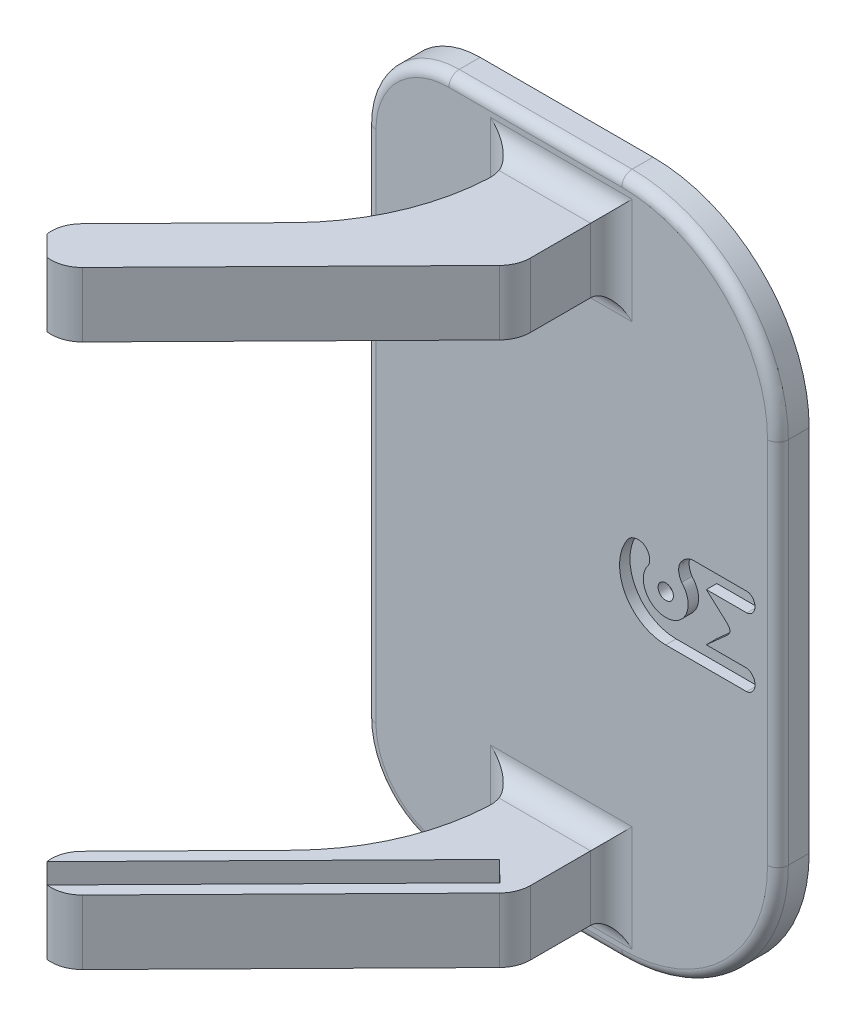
ISO-10303-21;
HEADER;
FILE_DESCRIPTION(('STEP AP214'),'2;1');
FILE_NAME('part.step','',(''),(''),'','','');
FILE_SCHEMA(('AUTOMOTIVE_DESIGN { 1 0 10303 214 1 1 1 1 }'));
ENDSEC;
DATA;
#1=APPLICATION_CONTEXT('core data for automotive mechanical design processes');
#2=APPLICATION_PROTOCOL_DEFINITION('international standard','automotive_design',2000,#1);
#3=PRODUCT_CONTEXT('',#1,'mechanical');
#4=PRODUCT('Part','Part','',(#3));
#5=PRODUCT_RELATED_PRODUCT_CATEGORY('part','',(#4));
#6=PRODUCT_DEFINITION_FORMATION('','',#4);
#7=PRODUCT_DEFINITION_CONTEXT('part definition',#1,'design');
#8=PRODUCT_DEFINITION('design','',#6,#7);
#9=PRODUCT_DEFINITION_SHAPE('','',#8);
#10=(LENGTH_UNIT() NAMED_UNIT(*) SI_UNIT(.MILLI.,.METRE.));
#11=(NAMED_UNIT(*) PLANE_ANGLE_UNIT() SI_UNIT($,.RADIAN.));
#12=(NAMED_UNIT(*) SI_UNIT($,.STERADIAN.) SOLID_ANGLE_UNIT());
#13=UNCERTAINTY_MEASURE_WITH_UNIT(LENGTH_MEASURE(1.E-05),#10,'distance_accuracy_value','');
#14=(GEOMETRIC_REPRESENTATION_CONTEXT(3) GLOBAL_UNCERTAINTY_ASSIGNED_CONTEXT((#13)) GLOBAL_UNIT_ASSIGNED_CONTEXT((#10,
#11,#12)) REPRESENTATION_CONTEXT('',''));
#15=CARTESIAN_POINT('',(0.,0.,0.));
#16=DIRECTION('',(0.,0.,1.));
#17=DIRECTION('',(1.,0.,0.));
#18=AXIS2_PLACEMENT_3D('',#15,#16,#17);
#19=CARTESIAN_POINT('',(0.,0.,-3.1429352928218));
#20=DIRECTION('',(0.,0.,-1.));
#21=DIRECTION('',(-1.,0.,0.));
#22=AXIS2_PLACEMENT_3D('',#19,#20,#21);
#23=PLANE('',#22);
#24=CARTESIAN_POINT('',(63.1659670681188,31.4551861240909,-3.1429352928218));
#25=DIRECTION('',(0.,0.,1.));
#26=DIRECTION('',(1.,0.,0.));
#27=AXIS2_PLACEMENT_3D('',#24,#25,#26);
#28=CIRCLE('',#27,0.731766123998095);
#29=CARTESIAN_POINT('',(63.8977331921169,31.4551861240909,-3.1429352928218));
#30=VERTEX_POINT('',#29);
#31=EDGE_CURVE('E481',#30,#30,#28,.T.);
#32=ORIENTED_EDGE('',*,*,#31,.F.);
#33=EDGE_LOOP('',(#32));
#34=FACE_BOUND('',#33,.T.);
#35=CARTESIAN_POINT('',(70.9619538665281,33.5771225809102,-3.1429352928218));
#36=CARTESIAN_POINT('',(71.2445189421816,33.6013162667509,-3.1429352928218));
#37=CARTESIAN_POINT('',(71.6460755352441,33.8989888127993,-3.1429352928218));
#38=CARTESIAN_POINT('',(71.7931225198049,34.5506298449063,-3.1429352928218));
#39=CARTESIAN_POINT('',(71.5812054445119,35.1376285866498,-3.1429352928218));
#40=CARTESIAN_POINT('',(71.193845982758,35.3711901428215,-3.1429352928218));
#41=CARTESIAN_POINT('',(70.9619538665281,35.3750928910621,-3.1429352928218));
#42=B_SPLINE_CURVE_WITH_KNOTS('',3,(#35,#36,#37,#38,#39,#40,#41),.UNSPECIFIED.,.F.,.F.,(4,1,1,1,
4),(0.,0.321053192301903,0.517682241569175,0.73825509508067,1.),.UNSPECIFIED.);
#43=CARTESIAN_POINT('',(70.9619538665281,33.5771225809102,-3.1429352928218));
#44=VERTEX_POINT('',#43);
#45=CARTESIAN_POINT('',(70.9619538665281,35.3750928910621,-3.1429352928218));
#46=VERTEX_POINT('',#45);
#47=EDGE_CURVE('E1480',#44,#46,#42,.T.);
#48=ORIENTED_EDGE('',*,*,#47,.F.);
#49=DIRECTION('',(1.,0.,0.));
#50=VECTOR('',#49,1.);
#51=CARTESIAN_POINT('',(0.,33.5771225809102,-3.1429352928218));
#52=LINE('',#51,#50);
#53=CARTESIAN_POINT('',(67.0694590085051,33.5771225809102,-3.1429352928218));
#54=VERTEX_POINT('',#53);
#55=EDGE_CURVE('E123',#54,#44,#52,.T.);
#56=ORIENTED_EDGE('',*,*,#55,.F.);
#57=DIRECTION('',(-0.741186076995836,0.671299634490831,0.));
#58=VECTOR('',#57,1.);
#59=CARTESIAN_POINT('',(46.9309596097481,51.8167626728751,-3.1429352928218));
#60=LINE('',#59,#58);
#61=CARTESIAN_POINT('',(69.0348133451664,31.7970815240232,-3.1429352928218));
#62=VERTEX_POINT('',#61);
#63=EDGE_CURVE('E475',#62,#54,#60,.T.);
#64=ORIENTED_EDGE('',*,*,#63,.F.);
#65=CARTESIAN_POINT('',(69.1154583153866,30.8196979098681,-3.1429352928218));
#66=CARTESIAN_POINT('',(69.5792186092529,31.2915422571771,-3.1429352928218));
#67=CARTESIAN_POINT('',(69.0348133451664,31.7970815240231,-3.1429352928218));
#68=B_SPLINE_CURVE_WITH_KNOTS('',2,(#65,#66,#67),.UNSPECIFIED.,.F.,.F.,(3,3),(0.,1.),.UNSPECIFIED.);
#69=CARTESIAN_POINT('',(69.1154583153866,30.8196979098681,-3.1429352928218));
#70=VERTEX_POINT('',#69);
#71=EDGE_CURVE('E478',#70,#62,#68,.T.);
#72=ORIENTED_EDGE('',*,*,#71,.F.);
#73=DIRECTION('',(0.745895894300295,0.666062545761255,0.));
#74=VECTOR('',#73,1.);
#75=CARTESIAN_POINT('',(15.3506981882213,-17.1906119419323,-3.1429352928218));
#76=LINE('',#75,#74);
#77=CARTESIAN_POINT('',(67.0549164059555,28.9796961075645,-3.1429352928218));
#78=VERTEX_POINT('',#77);
#79=EDGE_CURVE('E1527',#78,#70,#76,.T.);
#80=ORIENTED_EDGE('',*,*,#79,.F.);
#81=DIRECTION('',(1.,0.,0.));
#82=VECTOR('',#81,1.);
#83=CARTESIAN_POINT('',(0.,28.9796961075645,-3.1429352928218));
#84=LINE('',#83,#82);
#85=CARTESIAN_POINT('',(70.9619538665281,28.9796961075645,-3.1429352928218));
#86=VERTEX_POINT('',#85);
#87=EDGE_CURVE('E1521',#78,#86,#84,.T.);
#88=ORIENTED_EDGE('',*,*,#87,.T.);
#89=CARTESIAN_POINT('',(70.9438657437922,27.0191637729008,-3.1429352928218));
#90=CARTESIAN_POINT('',(71.4216359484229,27.0623911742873,-3.1429352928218));
#91=CARTESIAN_POINT('',(72.0671353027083,28.0105331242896,-3.1429352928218));
#92=CARTESIAN_POINT('',(71.4090080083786,28.9098878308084,-3.1429352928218));
#93=CARTESIAN_POINT('',(70.9619538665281,28.9796961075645,-3.1429352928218));
#94=B_SPLINE_CURVE_WITH_KNOTS('',3,(#89,#90,#91,#92,#93),.UNSPECIFIED.,.F.,.F.,(4,1,4),(0.,
0.510068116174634,1.),.UNSPECIFIED.);
#95=CARTESIAN_POINT('',(70.9438657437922,27.0191637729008,-3.1429352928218));
#96=VERTEX_POINT('',#95);
#97=EDGE_CURVE('E1516',#96,#86,#94,.T.);
#98=ORIENTED_EDGE('',*,*,#97,.F.);
#99=DIRECTION('',(1.,0.,0.));
#100=VECTOR('',#99,1.);
#101=CARTESIAN_POINT('',(0.,27.0191637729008,-3.1429352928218));
#102=LINE('',#101,#100);
#103=CARTESIAN_POINT('',(63.1659670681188,27.0191637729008,-3.1429352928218));
#104=VERTEX_POINT('',#103);
#105=EDGE_CURVE('E1513',#104,#96,#102,.T.);
#106=ORIENTED_EDGE('',*,*,#105,.F.);
#107=CARTESIAN_POINT('',(63.1659670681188,31.4551861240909,-3.1429352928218));
#108=DIRECTION('',(0.,0.,1.));
#109=DIRECTION('',(1.,0.,0.));
#110=AXIS2_PLACEMENT_3D('',#107,#108,#109);
#111=CIRCLE('',#110,4.43602235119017);
#112=CARTESIAN_POINT('',(59.529664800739,33.9959734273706,-3.1429352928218));
#113=VERTEX_POINT('',#112);
#114=EDGE_CURVE('E1507',#113,#104,#111,.T.);
#115=ORIENTED_EDGE('',*,*,#114,.F.);
#116=CARTESIAN_POINT('',(61.4171639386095,32.7114035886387,-3.1429352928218));
#117=CARTESIAN_POINT('',(61.8165866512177,33.1768092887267,-3.1429352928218));
#118=CARTESIAN_POINT('',(61.4125961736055,34.7613963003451,-3.1429352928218));
#119=CARTESIAN_POINT('',(59.8778987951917,34.4553402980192,-3.1429352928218));
#120=CARTESIAN_POINT('',(59.529664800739,33.9959734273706,-3.1429352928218));
#121=B_SPLINE_CURVE_WITH_KNOTS('',3,(#116,#117,#118,#119,#120),.UNSPECIFIED.,.F.,.F.,(4,1,4),
(0.,0.502782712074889,1.),.UNSPECIFIED.);
#122=CARTESIAN_POINT('',(61.4798446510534,32.7943597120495,-3.1429352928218));
#123=VERTEX_POINT('',#122);
#124=EDGE_CURVE('E1502',#123,#113,#121,.T.);
#125=ORIENTED_EDGE('',*,*,#124,.F.);
#126=CARTESIAN_POINT('',(63.1659670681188,31.4551861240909,-3.1429352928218));
#127=DIRECTION('',(0.,0.,1.));
#128=DIRECTION('',(1.,0.,0.));
#129=AXIS2_PLACEMENT_3D('',#126,#127,#128);
#130=CIRCLE('',#129,2.15322890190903);
#131=CARTESIAN_POINT('',(64.6912418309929,32.975032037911,-3.1429352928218));
#132=VERTEX_POINT('',#131);
#133=EDGE_CURVE('E1496',#123,#132,#130,.T.);
#134=ORIENTED_EDGE('',*,*,#133,.T.);
#135=CARTESIAN_POINT('',(64.6912418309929,32.975032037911,-3.1429352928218));
#136=CARTESIAN_POINT('',(64.4633363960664,33.3329010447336,-3.1429352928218));
#137=CARTESIAN_POINT('',(64.1749757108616,34.4559138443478,-3.1429352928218));
#138=CARTESIAN_POINT('',(65.1361624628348,35.2529942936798,-3.1429352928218));
#139=CARTESIAN_POINT('',(65.6829750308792,35.3750928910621,-3.1429352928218));
#140=B_SPLINE_CURVE_WITH_KNOTS('',3,(#135,#136,#137,#138,#139),.UNSPECIFIED.,.F.,.F.,(4,1,4),
(0.,0.429579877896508,1.),.UNSPECIFIED.);
#141=CARTESIAN_POINT('',(65.6829750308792,35.3750928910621,-3.1429352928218));
#142=VERTEX_POINT('',#141);
#143=EDGE_CURVE('E1491',#132,#142,#140,.T.);
#144=ORIENTED_EDGE('',*,*,#143,.T.);
#145=DIRECTION('',(1.,0.,0.));
#146=VECTOR('',#145,1.);
#147=CARTESIAN_POINT('',(0.,35.3750928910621,-3.1429352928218));
#148=LINE('',#147,#146);
#149=EDGE_CURVE('E1485',#142,#46,#148,.T.);
#150=ORIENTED_EDGE('',*,*,#149,.T.);
#151=EDGE_LOOP('',(#48,#56,#64,#72,#80,#88,#98,#106,#115,#125,#134,#144,#150));
#152=FACE_BOUND('',#151,.T.);
#153=DIRECTION('',(0.,-1.,0.));
#154=VECTOR('',#153,1.);
#155=CARTESIAN_POINT('',(72.9423103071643,0.,-3.14293529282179));
#156=LINE('',#155,#154);
#157=CARTESIAN_POINT('',(72.9423103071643,13.5784093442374,-3.14293529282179));
#158=VERTEX_POINT('',#157);
#159=CARTESIAN_POINT('',(72.9423103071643,48.9784093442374,-3.14293529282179));
#160=VERTEX_POINT('',#159);
#161=EDGE_CURVE('E707',#158,#160,#156,.F.);
#162=ORIENTED_EDGE('',*,*,#161,.T.);
#163=CARTESIAN_POINT('',(58.9423103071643,48.9784093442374,-3.14293529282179));
#164=DIRECTION('',(0.,0.,-1.));
#165=DIRECTION('',(-1.,0.,0.));
#166=AXIS2_PLACEMENT_3D('',#163,#164,#165);
#167=CIRCLE('',#166,14.);
#168=CARTESIAN_POINT('',(58.9423103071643,62.9784093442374,-3.14293529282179));
#169=VERTEX_POINT('',#168);
#170=EDGE_CURVE('E733',#160,#169,#167,.F.);
#171=ORIENTED_EDGE('',*,*,#170,.T.);
#172=DIRECTION('',(1.,0.,0.));
#173=VECTOR('',#172,1.);
#174=CARTESIAN_POINT('',(0.,62.9784093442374,-3.1429352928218));
#175=LINE('',#174,#173);
#176=CARTESIAN_POINT('',(42.3371680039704,62.9784093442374,-3.14293529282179));
#177=VERTEX_POINT('',#176);
#178=EDGE_CURVE('E731',#169,#177,#175,.F.);
#179=ORIENTED_EDGE('',*,*,#178,.T.);
#180=CARTESIAN_POINT('',(42.3371680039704,55.9784093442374,-3.14293529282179));
#181=DIRECTION('',(0.,0.,-1.));
#182=DIRECTION('',(-1.,0.,0.));
#183=AXIS2_PLACEMENT_3D('',#180,#181,#182);
#184=CIRCLE('',#183,7.);
#185=CARTESIAN_POINT('',(35.3371680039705,55.9784093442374,-3.14293529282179));
#186=VERTEX_POINT('',#185);
#187=EDGE_CURVE('E729',#177,#186,#184,.F.);
#188=ORIENTED_EDGE('',*,*,#187,.T.);
#189=DIRECTION('',(0.,1.,0.));
#190=VECTOR('',#189,1.);
#191=CARTESIAN_POINT('',(35.3371680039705,0.,-3.14293529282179));
#192=LINE('',#191,#190);
#193=CARTESIAN_POINT('',(35.3371680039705,6.57840934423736,-3.14293529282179));
#194=VERTEX_POINT('',#193);
#195=EDGE_CURVE('E727',#186,#194,#192,.F.);
#196=ORIENTED_EDGE('',*,*,#195,.T.);
#197=CARTESIAN_POINT('',(42.3371680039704,6.57840934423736,-3.14293529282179));
#198=DIRECTION('',(0.,0.,-1.));
#199=DIRECTION('',(-1.,0.,0.));
#200=AXIS2_PLACEMENT_3D('',#197,#198,#199);
#201=CIRCLE('',#200,7.);
#202=CARTESIAN_POINT('',(42.3371680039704,-0.421590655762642,-3.14293529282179));
#203=VERTEX_POINT('',#202);
#204=EDGE_CURVE('E725',#194,#203,#201,.F.);
#205=ORIENTED_EDGE('',*,*,#204,.T.);
#206=DIRECTION('',(-1.,0.,0.));
#207=VECTOR('',#206,1.);
#208=CARTESIAN_POINT('',(0.,-0.421590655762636,-3.1429352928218));
#209=LINE('',#208,#207);
#210=CARTESIAN_POINT('',(58.9423103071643,-0.421590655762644,-3.14293529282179));
#211=VERTEX_POINT('',#210);
#212=EDGE_CURVE('E723',#203,#211,#209,.F.);
#213=ORIENTED_EDGE('',*,*,#212,.T.);
#214=CARTESIAN_POINT('',(58.9423103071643,13.5784093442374,-3.14293529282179));
#215=DIRECTION('',(0.,0.,-1.));
#216=DIRECTION('',(-1.,0.,0.));
#217=AXIS2_PLACEMENT_3D('',#214,#215,#216);
#218=CIRCLE('',#217,14.);
#219=EDGE_CURVE('E721',#211,#158,#218,.F.);
#220=ORIENTED_EDGE('',*,*,#219,.T.);
#221=EDGE_LOOP('',(#162,#171,#179,#188,#196,#205,#213,#220));
#222=FACE_BOUND('',#221,.T.);
#223=DIRECTION('',(0.,1.,0.));
#224=VECTOR('',#223,1.);
#225=CARTESIAN_POINT('',(46.3191986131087,8.27840934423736,-3.14293529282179));
#226=LINE('',#225,#224);
#227=CARTESIAN_POINT('',(46.3191986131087,0.0784093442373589,-3.14293529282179));
#228=VERTEX_POINT('',#227);
#229=CARTESIAN_POINT('',(46.3191986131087,10.2784093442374,-3.14293529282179));
#230=VERTEX_POINT('',#229);
#231=EDGE_CURVE('E806',#228,#230,#226,.T.);
#232=ORIENTED_EDGE('',*,*,#231,.T.);
#233=DIRECTION('',(1.,0.,0.));
#234=VECTOR('',#233,1.);
#235=CARTESIAN_POINT('',(57.9423103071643,10.2784093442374,-3.14293529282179));
#236=LINE('',#235,#234);
#237=CARTESIAN_POINT('',(59.9423103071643,10.2784093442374,-3.14293529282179));
#238=VERTEX_POINT('',#237);
#239=EDGE_CURVE('E829',#230,#238,#236,.T.);
#240=ORIENTED_EDGE('',*,*,#239,.T.);
#241=DIRECTION('',(0.,1.,0.));
#242=VECTOR('',#241,1.);
#243=CARTESIAN_POINT('',(59.9423103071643,2.07840934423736,-3.14293529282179));
#244=LINE('',#243,#242);
#245=CARTESIAN_POINT('',(59.9423103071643,0.0784093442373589,-3.14293529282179));
#246=VERTEX_POINT('',#245);
#247=EDGE_CURVE('E827',#238,#246,#244,.F.);
#248=ORIENTED_EDGE('',*,*,#247,.T.);
#249=DIRECTION('',(1.,0.,0.));
#250=VECTOR('',#249,1.);
#251=CARTESIAN_POINT('',(0.,0.0784093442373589,-3.1429352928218));
#252=LINE('',#251,#250);
#253=EDGE_CURVE('E824',#246,#228,#252,.F.);
#254=ORIENTED_EDGE('',*,*,#253,.T.);
#255=EDGE_LOOP('',(#232,#240,#248,#254));
#256=FACE_BOUND('',#255,.T.);
#257=DIRECTION('',(-1.,0.,0.));
#258=VECTOR('',#257,1.);
#259=CARTESIAN_POINT('',(46.3191986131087,52.2784093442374,-3.14293529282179));
#260=LINE('',#259,#258);
#261=CARTESIAN_POINT('',(59.9423103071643,52.2784093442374,-3.14293529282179));
#262=VERTEX_POINT('',#261);
#263=CARTESIAN_POINT('',(46.3191986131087,52.2784093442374,-3.14293529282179));
#264=VERTEX_POINT('',#263);
#265=EDGE_CURVE('E836',#262,#264,#260,.T.);
#266=ORIENTED_EDGE('',*,*,#265,.T.);
#267=DIRECTION('',(0.,1.,0.));
#268=VECTOR('',#267,1.);
#269=CARTESIAN_POINT('',(46.3191986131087,0.,-3.14293529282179));
#270=LINE('',#269,#268);
#271=CARTESIAN_POINT('',(46.3191986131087,62.4784093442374,-3.14293529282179));
#272=VERTEX_POINT('',#271);
#273=EDGE_CURVE('E808',#264,#272,#270,.T.);
#274=ORIENTED_EDGE('',*,*,#273,.T.);
#275=DIRECTION('',(-1.,0.,0.));
#276=VECTOR('',#275,1.);
#277=CARTESIAN_POINT('',(0.,62.4784093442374,-3.1429352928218));
#278=LINE('',#277,#276);
#279=CARTESIAN_POINT('',(59.9423103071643,62.4784093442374,-3.14293529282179));
#280=VERTEX_POINT('',#279);
#281=EDGE_CURVE('E834',#272,#280,#278,.F.);
#282=ORIENTED_EDGE('',*,*,#281,.T.);
#283=DIRECTION('',(0.,1.,0.));
#284=VECTOR('',#283,1.);
#285=CARTESIAN_POINT('',(59.9423103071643,0.,-3.14293529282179));
#286=LINE('',#285,#284);
#287=EDGE_CURVE('E832',#280,#262,#286,.F.);
#288=ORIENTED_EDGE('',*,*,#287,.T.);
#289=EDGE_LOOP('',(#266,#274,#282,#288));
#290=FACE_BOUND('',#289,.T.);
#291=ADVANCED_FACE('F106',(#34,#152,#222,#256,#290),#23,.F.);
#292=CARTESIAN_POINT('',(34.6894237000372,3.27840934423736,27.7896267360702));
#293=DIRECTION('',(0.713053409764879,0.,0.701109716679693));
#294=DIRECTION('',(0.701109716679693,0.,-0.713053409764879));
#295=AXIS2_PLACEMENT_3D('',#292,#293,#294);
#296=PLANE('',#295);
#297=DIRECTION('',(0.,1.,0.));
#298=VECTOR('',#297,1.);
#299=CARTESIAN_POINT('',(34.6894237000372,3.27840934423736,27.7896267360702));
#300=LINE('',#299,#298);
#301=CARTESIAN_POINT('',(34.6894237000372,3.27840934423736,27.7896267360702));
#302=VERTEX_POINT('',#301);
#303=CARTESIAN_POINT('',(34.6894237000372,8.27840934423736,27.7896267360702));
#304=VERTEX_POINT('',#303);
#305=EDGE_CURVE('E1032',#302,#304,#300,.T.);
#306=ORIENTED_EDGE('',*,*,#305,.T.);
#307=DIRECTION('',(0.701109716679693,0.,-0.713053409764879));
#308=VECTOR('',#307,1.);
#309=CARTESIAN_POINT('',(34.6894237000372,8.27840934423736,27.7896267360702));
#310=LINE('',#309,#308);
#311=CARTESIAN_POINT('',(56.2453145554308,8.27840934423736,5.86652239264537));
#312=VERTEX_POINT('',#311);
#313=EDGE_CURVE('E999',#304,#312,#310,.T.);
#314=ORIENTED_EDGE('',*,*,#313,.T.);
#315=DIRECTION('',(0.,1.,0.));
#316=VECTOR('',#315,1.);
#317=CARTESIAN_POINT('',(56.2453145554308,3.27840934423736,5.86652239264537));
#318=LINE('',#317,#316);
#319=CARTESIAN_POINT('',(56.2453145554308,3.27840934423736,5.86652239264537));
#320=VERTEX_POINT('',#319);
#321=EDGE_CURVE('E1030',#320,#312,#318,.T.);
#322=ORIENTED_EDGE('',*,*,#321,.F.);
#323=DIRECTION('',(0.701109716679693,0.,-0.713053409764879));
#324=VECTOR('',#323,1.);
#325=CARTESIAN_POINT('',(34.6894237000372,3.27840934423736,27.7896267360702));
#326=LINE('',#325,#324);
#327=EDGE_CURVE('E1016',#302,#320,#326,.T.);
#328=ORIENTED_EDGE('',*,*,#327,.F.);
#329=EDGE_LOOP('',(#306,#314,#322,#328));
#330=FACE_BOUND('',#329,.T.);
#331=ADVANCED_FACE('F565',(#330),#296,.F.);
#332=CARTESIAN_POINT('',(56.2453145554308,3.27840934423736,5.86652239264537));
#333=DIRECTION('',(0.701109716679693,0.,-0.71305340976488));
#334=DIRECTION('',(-0.71305340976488,0.,-0.701109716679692));
#335=AXIS2_PLACEMENT_3D('',#332,#333,#334);
#336=PLANE('',#335);
#337=ORIENTED_EDGE('',*,*,#321,.T.);
#338=DIRECTION('',(-0.71305340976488,0.,-0.701109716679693));
#339=VECTOR('',#338,1.);
#340=CARTESIAN_POINT('',(56.2453145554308,8.27840934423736,5.86652239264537));
#341=LINE('',#340,#339);
#342=CARTESIAN_POINT('',(54.2857692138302,8.27840934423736,3.93979956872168));
#343=VERTEX_POINT('',#342);
#344=EDGE_CURVE('E1002',#312,#343,#341,.T.);
#345=ORIENTED_EDGE('',*,*,#344,.T.);
#346=DIRECTION('',(0.,1.,0.));
#347=VECTOR('',#346,1.);
#348=CARTESIAN_POINT('',(54.2857692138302,3.27840934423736,3.93979956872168));
#349=LINE('',#348,#347);
#350=CARTESIAN_POINT('',(54.2857692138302,3.27840934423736,3.93979956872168));
#351=VERTEX_POINT('',#350);
#352=EDGE_CURVE('E1028',#351,#343,#349,.T.);
#353=ORIENTED_EDGE('',*,*,#352,.F.);
#354=DIRECTION('',(-0.71305340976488,0.,-0.701109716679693));
#355=VECTOR('',#354,1.);
#356=CARTESIAN_POINT('',(56.2453145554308,3.27840934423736,5.86652239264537));
#357=LINE('',#356,#355);
#358=EDGE_CURVE('E1019',#320,#351,#357,.T.);
#359=ORIENTED_EDGE('',*,*,#358,.F.);
#360=EDGE_LOOP('',(#337,#345,#353,#359));
#361=FACE_BOUND('',#360,.T.);
#362=ADVANCED_FACE('F615',(#361),#336,.F.);
#363=CARTESIAN_POINT('',(54.2857692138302,3.27840934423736,3.93979956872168));
#364=DIRECTION('',(-0.713053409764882,0.,-0.70110971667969));
#365=DIRECTION('',(-0.70110971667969,0.,0.713053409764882));
#366=AXIS2_PLACEMENT_3D('',#363,#364,#365);
#367=PLANE('',#366);
#368=ORIENTED_EDGE('',*,*,#352,.T.);
#369=DIRECTION('',(-0.70110971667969,0.,0.713053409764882));
#370=VECTOR('',#369,1.);
#371=CARTESIAN_POINT('',(54.2857692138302,8.27840934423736,3.93979956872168));
#372=LINE('',#371,#370);
#373=CARTESIAN_POINT('',(32.7298783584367,8.27840934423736,25.8629039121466));
#374=VERTEX_POINT('',#373);
#375=EDGE_CURVE('E1005',#343,#374,#372,.T.);
#376=ORIENTED_EDGE('',*,*,#375,.T.);
#377=DIRECTION('',(0.,1.,0.));
#378=VECTOR('',#377,1.);
#379=CARTESIAN_POINT('',(32.7298783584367,3.27840934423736,25.8629039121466));
#380=LINE('',#379,#378);
#381=CARTESIAN_POINT('',(32.7298783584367,3.27840934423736,25.8629039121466));
#382=VERTEX_POINT('',#381);
#383=EDGE_CURVE('E1025',#382,#374,#380,.T.);
#384=ORIENTED_EDGE('',*,*,#383,.F.);
#385=DIRECTION('',(-0.70110971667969,0.,0.713053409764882));
#386=VECTOR('',#385,1.);
#387=CARTESIAN_POINT('',(54.2857692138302,3.27840934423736,3.93979956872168));
#388=LINE('',#387,#386);
#389=EDGE_CURVE('E1022',#351,#382,#388,.T.);
#390=ORIENTED_EDGE('',*,*,#389,.F.);
#391=EDGE_LOOP('',(#368,#376,#384,#390));
#392=FACE_BOUND('',#391,.T.);
#393=ADVANCED_FACE('F611',(#392),#367,.F.);
#394=CARTESIAN_POINT('',(49.3371680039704,3.27840934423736,7.26112989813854));
#395=DIRECTION('',(0.713053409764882,0.,0.701109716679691));
#396=DIRECTION('',(0.701109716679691,0.,-0.713053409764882));
#397=AXIS2_PLACEMENT_3D('',#394,#395,#396);
#398=PLANE('',#397);
#399=DIRECTION('',(0.70110971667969,0.,-0.713053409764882));
#400=VECTOR('',#399,1.);
#401=CARTESIAN_POINT('',(49.3371680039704,8.27840934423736,7.26112989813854));
#402=LINE('',#401,#400);
#403=CARTESIAN_POINT('',(33.5568775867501,8.27840934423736,23.3102440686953));
#404=VERTEX_POINT('',#403);
#405=CARTESIAN_POINT('',(43.5982361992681,8.27840934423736,13.0978267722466));
#406=VERTEX_POINT('',#405);
#407=EDGE_CURVE('E1008',#404,#406,#402,.T.);
#408=ORIENTED_EDGE('',*,*,#407,.T.);
#409=DIRECTION('',(0.,1.,0.));
#410=VECTOR('',#409,1.);
#411=CARTESIAN_POINT('',(43.5982361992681,2.07840934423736,13.0978267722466));
#412=LINE('',#411,#410);
#413=CARTESIAN_POINT('',(43.5982361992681,2.07840934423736,13.0978267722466));
#414=VERTEX_POINT('',#413);
#415=EDGE_CURVE('E1053',#406,#414,#412,.F.);
#416=ORIENTED_EDGE('',*,*,#415,.T.);
#417=DIRECTION('',(0.701109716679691,0.,-0.713053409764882));
#418=VECTOR('',#417,1.);
#419=CARTESIAN_POINT('',(33.5568775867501,2.07840934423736,23.3102440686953));
#420=LINE('',#419,#418);
#421=CARTESIAN_POINT('',(33.5568775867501,2.07840934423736,23.3102440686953));
#422=VERTEX_POINT('',#421);
#423=EDGE_CURVE('E976',#422,#414,#420,.T.);
#424=ORIENTED_EDGE('',*,*,#423,.F.);
#425=DIRECTION('',(0.,1.,0.));
#426=VECTOR('',#425,1.);
#427=CARTESIAN_POINT('',(33.5568775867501,3.27840934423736,23.3102440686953));
#428=LINE('',#427,#426);
#429=EDGE_CURVE('E1035',#422,#404,#428,.T.);
#430=ORIENTED_EDGE('',*,*,#429,.T.);
#431=EDGE_LOOP('',(#408,#416,#424,#430));
#432=FACE_BOUND('',#431,.T.);
#433=ADVANCED_FACE('F607',(#432),#398,.F.);
#434=CARTESIAN_POINT('',(57.9423103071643,3.27840934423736,-3.14293529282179));
#435=DIRECTION('',(-1.,0.,0.));
#436=DIRECTION('',(0.,0.,1.));
#437=AXIS2_PLACEMENT_3D('',#434,#435,#436);
#438=PLANE('',#437);
#439=DIRECTION('',(0.,0.,1.));
#440=VECTOR('',#439,1.);
#441=CARTESIAN_POINT('',(57.9423103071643,2.07840934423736,-3.14293529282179));
#442=LINE('',#441,#440);
#443=CARTESIAN_POINT('',(57.9423103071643,2.07840934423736,-1.14293529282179));
#444=VERTEX_POINT('',#443);
#445=CARTESIAN_POINT('',(57.9423103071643,2.07840934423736,4.62436534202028));
#446=VERTEX_POINT('',#445);
#447=EDGE_CURVE('E979',#444,#446,#442,.T.);
#448=ORIENTED_EDGE('',*,*,#447,.F.);
#449=DIRECTION('',(0.,1.,0.));
#450=VECTOR('',#449,1.);
#451=CARTESIAN_POINT('',(57.9423103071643,8.27840934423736,-1.14293529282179));
#452=LINE('',#451,#450);
#453=CARTESIAN_POINT('',(57.9423103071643,8.27840934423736,-1.14293529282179));
#454=VERTEX_POINT('',#453);
#455=EDGE_CURVE('E847',#444,#454,#452,.T.);
#456=ORIENTED_EDGE('',*,*,#455,.T.);
#457=DIRECTION('',(0.,0.,1.));
#458=VECTOR('',#457,1.);
#459=CARTESIAN_POINT('',(57.9423103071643,8.27840934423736,-3.14293529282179));
#460=LINE('',#459,#458);
#461=CARTESIAN_POINT('',(57.9423103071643,8.27840934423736,4.62436534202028));
#462=VERTEX_POINT('',#461);
#463=EDGE_CURVE('E1011',#454,#462,#460,.T.);
#464=ORIENTED_EDGE('',*,*,#463,.T.);
#465=DIRECTION('',(0.,1.,0.));
#466=VECTOR('',#465,1.);
#467=CARTESIAN_POINT('',(57.9423103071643,3.27840934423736,4.62436534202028));
#468=LINE('',#467,#466);
#469=EDGE_CURVE('E1050',#462,#446,#468,.F.);
#470=ORIENTED_EDGE('',*,*,#469,.T.);
#471=EDGE_LOOP('',(#448,#456,#464,#470));
#472=FACE_BOUND('',#471,.T.);
#473=ADVANCED_FACE('F603',(#472),#438,.F.);
#474=CARTESIAN_POINT('',(35.5450877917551,3.27840934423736,28.6309583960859));
#475=DIRECTION('',(-0.713053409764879,0.,-0.701109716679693));
#476=DIRECTION('',(-0.701109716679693,0.,0.713053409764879));
#477=AXIS2_PLACEMENT_3D('',#474,#475,#476);
#478=PLANE('',#477);
#479=DIRECTION('',(-0.701109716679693,0.,0.713053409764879));
#480=VECTOR('',#479,1.);
#481=CARTESIAN_POINT('',(35.5450877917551,8.27840934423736,28.6309583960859));
#482=LINE('',#481,#480);
#483=CARTESIAN_POINT('',(57.0814705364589,8.27840934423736,6.72769449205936));
#484=VERTEX_POINT('',#483);
#485=CARTESIAN_POINT('',(37.2277511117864,8.27840934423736,26.9196302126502));
#486=VERTEX_POINT('',#485);
#487=EDGE_CURVE('E1013',#484,#486,#482,.T.);
#488=ORIENTED_EDGE('',*,*,#487,.T.);
#489=DIRECTION('',(0.,-1.,0.));
#490=VECTOR('',#489,1.);
#491=CARTESIAN_POINT('',(37.2277511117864,3.27840934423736,26.9196302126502));
#492=LINE('',#491,#490);
#493=CARTESIAN_POINT('',(37.2277511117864,2.07840934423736,26.9196302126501));
#494=VERTEX_POINT('',#493);
#495=EDGE_CURVE('E1048',#486,#494,#492,.T.);
#496=ORIENTED_EDGE('',*,*,#495,.T.);
#497=DIRECTION('',(-0.701109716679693,0.,0.713053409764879));
#498=VECTOR('',#497,1.);
#499=CARTESIAN_POINT('',(57.0814705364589,2.07840934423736,6.72769449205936));
#500=LINE('',#499,#498);
#501=CARTESIAN_POINT('',(57.0814705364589,2.07840934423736,6.72769449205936));
#502=VERTEX_POINT('',#501);
#503=EDGE_CURVE('E984',#502,#494,#500,.T.);
#504=ORIENTED_EDGE('',*,*,#503,.F.);
#505=DIRECTION('',(0.,1.,0.));
#506=VECTOR('',#505,1.);
#507=CARTESIAN_POINT('',(57.0814705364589,3.27840934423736,6.72769449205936));
#508=LINE('',#507,#506);
#509=EDGE_CURVE('E1045',#502,#484,#508,.T.);
#510=ORIENTED_EDGE('',*,*,#509,.T.);
#511=EDGE_LOOP('',(#488,#496,#504,#510));
#512=FACE_BOUND('',#511,.T.);
#513=ADVANCED_FACE('F599',(#512),#478,.F.);
#514=CARTESIAN_POINT('',(0.,8.27840934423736,0.));
#515=DIRECTION('',(0.,-1.,0.));
#516=DIRECTION('',(0.,0.,-1.));
#517=AXIS2_PLACEMENT_3D('',#514,#515,#516);
#518=PLANE('',#517);
#519=ORIENTED_EDGE('',*,*,#463,.F.);
#520=DIRECTION('',(1.,0.,0.));
#521=VECTOR('',#520,1.);
#522=CARTESIAN_POINT('',(46.3191986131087,8.27840934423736,-1.14293529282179));
#523=LINE('',#522,#521);
#524=CARTESIAN_POINT('',(49.1476257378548,8.27840934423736,-1.14293529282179));
#525=VERTEX_POINT('',#524);
#526=EDGE_CURVE('E845',#454,#525,#523,.F.);
#527=ORIENTED_EDGE('',*,*,#526,.T.);
#528=CARTESIAN_POINT('',(46.3191986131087,8.27840934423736,-0.142935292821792));
#529=DIRECTION('',(0.,-1.,0.));
#530=DIRECTION('',(0.,0.,-1.));
#531=AXIS2_PLACEMENT_3D('',#528,#529,#530);
#532=CIRCLE('',#531,3.);
#533=CARTESIAN_POINT('',(49.316027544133,8.27840934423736,-0.00503548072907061));
#534=VERTEX_POINT('',#533);
#535=EDGE_CURVE('E819',#525,#534,#532,.T.);
#536=ORIENTED_EDGE('',*,*,#535,.T.);
#537=CARTESIAN_POINT('',(29.3371680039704,8.27840934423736,-0.924367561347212));
#538=DIRECTION('',(0.,-1.,0.));
#539=DIRECTION('',(0.,0.,-1.));
#540=AXIS2_PLACEMENT_3D('',#537,#538,#539);
#541=CIRCLE('',#540,20.);
#542=EDGE_CURVE('E1055',#534,#406,#541,.T.);
#543=ORIENTED_EDGE('',*,*,#542,.T.);
#544=ORIENTED_EDGE('',*,*,#407,.F.);
#545=CARTESIAN_POINT('',(35.6960378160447,8.27840934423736,25.4135732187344));
#546=DIRECTION('',(0.,-1.,0.));
#547=DIRECTION('',(0.,0.,-1.));
#548=AXIS2_PLACEMENT_3D('',#545,#546,#547);
#549=CIRCLE('',#548,3.);
#550=EDGE_CURVE('E1043',#404,#374,#549,.F.);
#551=ORIENTED_EDGE('',*,*,#550,.T.);
#552=ORIENTED_EDGE('',*,*,#375,.F.);
#553=ORIENTED_EDGE('',*,*,#344,.F.);
#554=ORIENTED_EDGE('',*,*,#313,.F.);
#555=CARTESIAN_POINT('',(35.0885908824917,8.27840934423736,24.8163010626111));
#556=DIRECTION('',(0.,-1.,0.));
#557=DIRECTION('',(0.,0.,-1.));
#558=AXIS2_PLACEMENT_3D('',#555,#556,#557);
#559=CIRCLE('',#558,3.);
#560=EDGE_CURVE('E1041',#304,#486,#559,.F.);
#561=ORIENTED_EDGE('',*,*,#560,.T.);
#562=ORIENTED_EDGE('',*,*,#487,.F.);
#563=CARTESIAN_POINT('',(54.9423103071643,8.27840934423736,4.62436534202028));
#564=DIRECTION('',(0.,-1.,0.));
#565=DIRECTION('',(0.,0.,-1.));
#566=AXIS2_PLACEMENT_3D('',#563,#564,#565);
#567=CIRCLE('',#566,3.);
#568=EDGE_CURVE('E1038',#484,#462,#567,.F.);
#569=ORIENTED_EDGE('',*,*,#568,.T.);
#570=EDGE_LOOP('',(#519,#527,#536,#543,#544,#551,#552,#553,#554,#561,#562,#569));
#571=FACE_BOUND('',#570,.T.);
#572=ADVANCED_FACE('F595',(#571),#518,.F.);
#573=CARTESIAN_POINT('',(35.6960378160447,3.27840934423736,25.4135732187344));
#574=DIRECTION('',(0.,1.,0.));
#575=DIRECTION('',(0.,0.,1.));
#576=AXIS2_PLACEMENT_3D('',#573,#574,#575);
#577=CYLINDRICAL_SURFACE('',#576,3.);
#578=ORIENTED_EDGE('',*,*,#429,.F.);
#579=CARTESIAN_POINT('',(35.6960378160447,2.07840934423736,25.4135732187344));
#580=DIRECTION('',(0.,-1.,0.));
#581=DIRECTION('',(0.,0.,-1.));
#582=AXIS2_PLACEMENT_3D('',#579,#580,#581);
#583=CIRCLE('',#582,3.);
#584=CARTESIAN_POINT('',(32.7298783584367,2.07840934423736,25.8629039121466));
#585=VERTEX_POINT('',#584);
#586=EDGE_CURVE('E973',#585,#422,#583,.T.);
#587=ORIENTED_EDGE('',*,*,#586,.F.);
#588=DIRECTION('',(0.,1.,0.));
#589=VECTOR('',#588,1.);
#590=CARTESIAN_POINT('',(32.7298783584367,2.07840934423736,25.8629039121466));
#591=LINE('',#590,#589);
#592=EDGE_CURVE('E991',#585,#382,#591,.T.);
#593=ORIENTED_EDGE('',*,*,#592,.T.);
#594=ORIENTED_EDGE('',*,*,#383,.T.);
#595=ORIENTED_EDGE('',*,*,#550,.F.);
#596=EDGE_LOOP('',(#578,#587,#593,#594,#595));
#597=FACE_BOUND('',#596,.T.);
#598=ADVANCED_FACE('F598',(#597),#577,.T.);
#599=CARTESIAN_POINT('',(35.0885908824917,3.27840934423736,24.8163010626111));
#600=DIRECTION('',(0.,-1.,0.));
#601=DIRECTION('',(0.,0.,-1.));
#602=AXIS2_PLACEMENT_3D('',#599,#600,#601);
#603=CYLINDRICAL_SURFACE('',#602,3.);
#604=ORIENTED_EDGE('',*,*,#305,.F.);
#605=DIRECTION('',(0.,1.,0.));
#606=VECTOR('',#605,1.);
#607=CARTESIAN_POINT('',(34.6894237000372,2.07840934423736,27.7896267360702));
#608=LINE('',#607,#606);
#609=CARTESIAN_POINT('',(34.6894237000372,2.07840934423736,27.7896267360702));
#610=VERTEX_POINT('',#609);
#611=EDGE_CURVE('E996',#610,#302,#608,.T.);
#612=ORIENTED_EDGE('',*,*,#611,.F.);
#613=CARTESIAN_POINT('',(35.0885908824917,2.07840934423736,24.8163010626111));
#614=DIRECTION('',(0.,-1.,0.));
#615=DIRECTION('',(0.,0.,-1.));
#616=AXIS2_PLACEMENT_3D('',#613,#614,#615);
#617=CIRCLE('',#616,3.);
#618=EDGE_CURVE('E987',#494,#610,#617,.T.);
#619=ORIENTED_EDGE('',*,*,#618,.F.);
#620=ORIENTED_EDGE('',*,*,#495,.F.);
#621=ORIENTED_EDGE('',*,*,#560,.F.);
#622=EDGE_LOOP('',(#604,#612,#619,#620,#621));
#623=FACE_BOUND('',#622,.T.);
#624=ADVANCED_FACE('F625',(#623),#603,.T.);
#625=CARTESIAN_POINT('',(54.9423103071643,3.27840934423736,4.62436534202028));
#626=DIRECTION('',(0.,1.,0.));
#627=DIRECTION('',(0.,0.,1.));
#628=AXIS2_PLACEMENT_3D('',#625,#626,#627);
#629=CYLINDRICAL_SURFACE('',#628,3.);
#630=ORIENTED_EDGE('',*,*,#509,.F.);
#631=CARTESIAN_POINT('',(54.9423103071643,2.07840934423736,4.62436534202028));
#632=DIRECTION('',(0.,-1.,0.));
#633=DIRECTION('',(0.,0.,-1.));
#634=AXIS2_PLACEMENT_3D('',#631,#632,#633);
#635=CIRCLE('',#634,3.);
#636=EDGE_CURVE('E981',#446,#502,#635,.T.);
#637=ORIENTED_EDGE('',*,*,#636,.F.);
#638=ORIENTED_EDGE('',*,*,#469,.F.);
#639=ORIENTED_EDGE('',*,*,#568,.F.);
#640=EDGE_LOOP('',(#630,#637,#638,#639));
#641=FACE_BOUND('',#640,.T.);
#642=ADVANCED_FACE('F590',(#641),#629,.T.);
#643=CARTESIAN_POINT('',(35.6960378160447,3.27840934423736,25.4135732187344));
#644=DIRECTION('',(0.,-1.,0.));
#645=DIRECTION('',(0.,0.,-1.));
#646=AXIS2_PLACEMENT_3D('',#643,#644,#645);
#647=PLANE('',#646);
#648=ORIENTED_EDGE('',*,*,#358,.T.);
#649=ORIENTED_EDGE('',*,*,#389,.T.);
#650=DIRECTION('',(-0.71305340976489,0.,-0.701109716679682));
#651=VECTOR('',#650,1.);
#652=CARTESIAN_POINT('',(32.7298783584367,3.27840934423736,25.8629039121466));
#653=LINE('',#652,#651);
#654=EDGE_CURVE('E972',#302,#382,#653,.T.);
#655=ORIENTED_EDGE('',*,*,#654,.F.);
#656=ORIENTED_EDGE('',*,*,#327,.T.);
#657=EDGE_LOOP('',(#648,#649,#655,#656));
#658=FACE_BOUND('',#657,.T.);
#659=ADVANCED_FACE('F587',(#658),#647,.F.);
#660=CARTESIAN_POINT('',(32.7298783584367,2.07840934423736,25.8629039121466));
#661=DIRECTION('',(0.701109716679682,0.,-0.71305340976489));
#662=DIRECTION('',(-0.71305340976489,0.,-0.701109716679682));
#663=AXIS2_PLACEMENT_3D('',#660,#661,#662);
#664=PLANE('',#663);
#665=ORIENTED_EDGE('',*,*,#654,.T.);
#666=ORIENTED_EDGE('',*,*,#592,.F.);
#667=DIRECTION('',(-0.71305340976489,0.,-0.701109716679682));
#668=VECTOR('',#667,1.);
#669=CARTESIAN_POINT('',(32.7298783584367,2.07840934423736,25.8629039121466));
#670=LINE('',#669,#668);
#671=EDGE_CURVE('E989',#610,#585,#670,.T.);
#672=ORIENTED_EDGE('',*,*,#671,.F.);
#673=ORIENTED_EDGE('',*,*,#611,.T.);
#674=EDGE_LOOP('',(#665,#666,#672,#673));
#675=FACE_BOUND('',#674,.T.);
#676=ADVANCED_FACE('F585',(#675),#664,.F.);
#677=CARTESIAN_POINT('',(35.6960378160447,2.07840934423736,25.4135732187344));
#678=DIRECTION('',(0.,-1.,0.));
#679=DIRECTION('',(0.,0.,-1.));
#680=AXIS2_PLACEMENT_3D('',#677,#678,#679);
#681=PLANE('',#680);
#682=CARTESIAN_POINT('',(46.3191986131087,2.07840934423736,-0.142935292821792));
#683=DIRECTION('',(0.,-1.,0.));
#684=DIRECTION('',(0.,0.,-1.));
#685=AXIS2_PLACEMENT_3D('',#682,#683,#684);
#686=CIRCLE('',#685,3.);
#687=CARTESIAN_POINT('',(49.316027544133,2.07840934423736,-0.00503548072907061));
#688=VERTEX_POINT('',#687);
#689=CARTESIAN_POINT('',(49.1476257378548,2.07840934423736,-1.14293529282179));
#690=VERTEX_POINT('',#689);
#691=EDGE_CURVE('E821',#688,#690,#686,.F.);
#692=ORIENTED_EDGE('',*,*,#691,.T.);
#693=DIRECTION('',(1.,0.,0.));
#694=VECTOR('',#693,1.);
#695=CARTESIAN_POINT('',(35.6960378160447,2.07840934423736,-1.14293529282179));
#696=LINE('',#695,#694);
#697=EDGE_CURVE('E848',#690,#444,#696,.T.);
#698=ORIENTED_EDGE('',*,*,#697,.T.);
#699=ORIENTED_EDGE('',*,*,#447,.T.);
#700=ORIENTED_EDGE('',*,*,#636,.T.);
#701=ORIENTED_EDGE('',*,*,#503,.T.);
#702=ORIENTED_EDGE('',*,*,#618,.T.);
#703=ORIENTED_EDGE('',*,*,#671,.T.);
#704=ORIENTED_EDGE('',*,*,#586,.T.);
#705=ORIENTED_EDGE('',*,*,#423,.T.);
#706=CARTESIAN_POINT('',(29.3371680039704,2.07840934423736,-0.924367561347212));
#707=DIRECTION('',(0.,-1.,0.));
#708=DIRECTION('',(0.,0.,-1.));
#709=AXIS2_PLACEMENT_3D('',#706,#707,#708);
#710=CIRCLE('',#709,20.);
#711=EDGE_CURVE('E1057',#414,#688,#710,.F.);
#712=ORIENTED_EDGE('',*,*,#711,.T.);
#713=EDGE_LOOP('',(#692,#698,#699,#700,#701,#702,#703,#704,#705,#712));
#714=FACE_BOUND('',#713,.T.);
#715=ADVANCED_FACE('F582',(#714),#681,.T.);
#716=CARTESIAN_POINT('',(29.3371680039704,3.27840934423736,-0.924367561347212));
#717=DIRECTION('',(0.,-1.,0.));
#718=DIRECTION('',(0.,0.,-1.));
#719=AXIS2_PLACEMENT_3D('',#716,#717,#718);
#720=CYLINDRICAL_SURFACE('',#719,20.);
#721=ORIENTED_EDGE('',*,*,#542,.F.);
#722=DIRECTION('',(0.,-1.,0.));
#723=VECTOR('',#722,1.);
#724=CARTESIAN_POINT('',(49.3160275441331,3.27840934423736,-0.0050354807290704));
#725=LINE('',#724,#723);
#726=EDGE_CURVE('E812',#534,#688,#725,.T.);
#727=ORIENTED_EDGE('',*,*,#726,.T.);
#728=ORIENTED_EDGE('',*,*,#711,.F.);
#729=ORIENTED_EDGE('',*,*,#415,.F.);
#730=EDGE_LOOP('',(#721,#727,#728,#729));
#731=FACE_BOUND('',#730,.T.);
#732=ADVANCED_FACE('F580',(#731),#720,.F.);
#733=CARTESIAN_POINT('',(34.3371680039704,-1.42159065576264,-6.14293529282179));
#734=DIRECTION('',(1.,0.,0.));
#735=DIRECTION('',(0.,0.,-1.));
#736=AXIS2_PLACEMENT_3D('',#733,#734,#735);
#737=PLANE('',#736);
#738=DIRECTION('',(0.,0.,1.));
#739=VECTOR('',#738,1.);
#740=CARTESIAN_POINT('',(34.3371680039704,6.57840934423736,-6.14293529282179));
#741=LINE('',#740,#739);
#742=CARTESIAN_POINT('',(34.3371680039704,6.57840934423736,-6.14293529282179));
#743=VERTEX_POINT('',#742);
#744=CARTESIAN_POINT('',(34.3371680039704,6.57840934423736,-4.14293529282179));
#745=VERTEX_POINT('',#744);
#746=EDGE_CURVE('E786',#743,#745,#741,.T.);
#747=ORIENTED_EDGE('',*,*,#746,.T.);
#748=DIRECTION('',(0.,1.,0.));
#749=VECTOR('',#748,1.);
#750=CARTESIAN_POINT('',(34.3371680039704,-1.42159065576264,-4.14293529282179));
#751=LINE('',#750,#749);
#752=CARTESIAN_POINT('',(34.3371680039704,55.9784093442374,-4.14293529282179));
#753=VERTEX_POINT('',#752);
#754=EDGE_CURVE('E743',#745,#753,#751,.T.);
#755=ORIENTED_EDGE('',*,*,#754,.T.);
#756=DIRECTION('',(0.,0.,1.));
#757=VECTOR('',#756,1.);
#758=CARTESIAN_POINT('',(34.3371680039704,55.9784093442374,-6.14293529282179));
#759=LINE('',#758,#757);
#760=CARTESIAN_POINT('',(34.3371680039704,55.9784093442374,-6.14293529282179));
#761=VERTEX_POINT('',#760);
#762=EDGE_CURVE('E792',#753,#761,#759,.F.);
#763=ORIENTED_EDGE('',*,*,#762,.T.);
#764=DIRECTION('',(0.,1.,0.));
#765=VECTOR('',#764,1.);
#766=CARTESIAN_POINT('',(34.3371680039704,-1.42159065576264,-6.14293529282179));
#767=LINE('',#766,#765);
#768=EDGE_CURVE('E791',#743,#761,#767,.T.);
#769=ORIENTED_EDGE('',*,*,#768,.F.);
#770=EDGE_LOOP('',(#747,#755,#763,#769));
#771=FACE_BOUND('',#770,.T.);
#772=ADVANCED_FACE('F576',(#771),#737,.F.);
#773=CARTESIAN_POINT('',(34.3371680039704,63.9784093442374,-6.14293529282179));
#774=DIRECTION('',(0.,-1.,0.));
#775=DIRECTION('',(0.,0.,-1.));
#776=AXIS2_PLACEMENT_3D('',#773,#774,#775);
#777=PLANE('',#776);
#778=DIRECTION('',(0.,0.,1.));
#779=VECTOR('',#778,1.);
#780=CARTESIAN_POINT('',(42.3371680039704,63.9784093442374,-6.14293529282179));
#781=LINE('',#780,#779);
#782=CARTESIAN_POINT('',(42.3371680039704,63.9784093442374,-6.14293529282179));
#783=VERTEX_POINT('',#782);
#784=CARTESIAN_POINT('',(42.3371680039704,63.9784093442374,-4.14293529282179));
#785=VERTEX_POINT('',#784);
#786=EDGE_CURVE('E793',#783,#785,#781,.T.);
#787=ORIENTED_EDGE('',*,*,#786,.T.);
#788=DIRECTION('',(1.,0.,0.));
#789=VECTOR('',#788,1.);
#790=CARTESIAN_POINT('',(34.3371680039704,63.9784093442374,-4.14293529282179));
#791=LINE('',#790,#789);
#792=CARTESIAN_POINT('',(58.9423103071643,63.9784093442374,-4.14293529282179));
#793=VERTEX_POINT('',#792);
#794=EDGE_CURVE('E739',#785,#793,#791,.T.);
#795=ORIENTED_EDGE('',*,*,#794,.T.);
#796=DIRECTION('',(0.,0.,1.));
#797=VECTOR('',#796,1.);
#798=CARTESIAN_POINT('',(58.9423103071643,63.9784093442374,-6.14293529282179));
#799=LINE('',#798,#797);
#800=CARTESIAN_POINT('',(58.9423103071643,63.9784093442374,-6.14293529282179));
#801=VERTEX_POINT('',#800);
#802=EDGE_CURVE('E1064',#793,#801,#799,.F.);
#803=ORIENTED_EDGE('',*,*,#802,.T.);
#804=DIRECTION('',(1.,0.,0.));
#805=VECTOR('',#804,1.);
#806=CARTESIAN_POINT('',(34.3371680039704,63.9784093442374,-6.14293529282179));
#807=LINE('',#806,#805);
#808=EDGE_CURVE('E963',#783,#801,#807,.T.);
#809=ORIENTED_EDGE('',*,*,#808,.F.);
#810=EDGE_LOOP('',(#787,#795,#803,#809));
#811=FACE_BOUND('',#810,.T.);
#812=ADVANCED_FACE('F573',(#811),#777,.F.);
#813=CARTESIAN_POINT('',(73.9423103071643,-1.42159065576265,-6.14293529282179));
#814=DIRECTION('',(-1.,0.,0.));
#815=DIRECTION('',(0.,0.,1.));
#816=AXIS2_PLACEMENT_3D('',#813,#814,#815);
#817=PLANE('',#816);
#818=DIRECTION('',(0.,0.,1.));
#819=VECTOR('',#818,1.);
#820=CARTESIAN_POINT('',(73.9423103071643,48.9784093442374,-6.14293529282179));
#821=LINE('',#820,#819);
#822=CARTESIAN_POINT('',(73.9423103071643,48.9784093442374,-6.14293529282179));
#823=VERTEX_POINT('',#822);
#824=CARTESIAN_POINT('',(73.9423103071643,48.9784093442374,-4.14293529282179));
#825=VERTEX_POINT('',#824);
#826=EDGE_CURVE('E1062',#823,#825,#821,.T.);
#827=ORIENTED_EDGE('',*,*,#826,.T.);
#828=DIRECTION('',(0.,-1.,0.));
#829=VECTOR('',#828,1.);
#830=CARTESIAN_POINT('',(73.9423103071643,-1.42159065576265,-4.14293529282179));
#831=LINE('',#830,#829);
#832=CARTESIAN_POINT('',(73.9423103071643,13.5784093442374,-4.14293529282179));
#833=VERTEX_POINT('',#832);
#834=EDGE_CURVE('E12',#825,#833,#831,.T.);
#835=ORIENTED_EDGE('',*,*,#834,.T.);
#836=DIRECTION('',(0.,0.,1.));
#837=VECTOR('',#836,1.);
#838=CARTESIAN_POINT('',(73.9423103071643,13.5784093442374,-6.14293529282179));
#839=LINE('',#838,#837);
#840=CARTESIAN_POINT('',(73.9423103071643,13.5784093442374,-6.14293529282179));
#841=VERTEX_POINT('',#840);
#842=EDGE_CURVE('E1060',#833,#841,#839,.F.);
#843=ORIENTED_EDGE('',*,*,#842,.T.);
#844=DIRECTION('',(0.,-1.,0.));
#845=VECTOR('',#844,1.);
#846=CARTESIAN_POINT('',(73.9423103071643,-1.42159065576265,-6.14293529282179));
#847=LINE('',#846,#845);
#848=EDGE_CURVE('E966',#823,#841,#847,.T.);
#849=ORIENTED_EDGE('',*,*,#848,.F.);
#850=EDGE_LOOP('',(#827,#835,#843,#849));
#851=FACE_BOUND('',#850,.T.);
#852=ADVANCED_FACE('F569',(#851),#817,.F.);
#853=CARTESIAN_POINT('',(34.3371680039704,-1.42159065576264,-6.14293529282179));
#854=DIRECTION('',(0.,1.,0.));
#855=DIRECTION('',(-1.,0.,0.));
#856=AXIS2_PLACEMENT_3D('',#853,#854,#855);
#857=PLANE('',#856);
#858=DIRECTION('',(0.,0.,1.));
#859=VECTOR('',#858,1.);
#860=CARTESIAN_POINT('',(58.9423103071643,-1.42159065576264,-6.14293529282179));
#861=LINE('',#860,#859);
#862=CARTESIAN_POINT('',(58.9423103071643,-1.42159065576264,-6.14293529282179));
#863=VERTEX_POINT('',#862);
#864=CARTESIAN_POINT('',(58.9423103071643,-1.42159065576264,-4.14293529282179));
#865=VERTEX_POINT('',#864);
#866=EDGE_CURVE('E798',#863,#865,#861,.T.);
#867=ORIENTED_EDGE('',*,*,#866,.T.);
#868=DIRECTION('',(-1.,0.,0.));
#869=VECTOR('',#868,1.);
#870=CARTESIAN_POINT('',(34.3371680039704,-1.42159065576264,-4.14293529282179));
#871=LINE('',#870,#869);
#872=CARTESIAN_POINT('',(42.3371680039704,-1.42159065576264,-4.14293529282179));
#873=VERTEX_POINT('',#872);
#874=EDGE_CURVE('E747',#865,#873,#871,.T.);
#875=ORIENTED_EDGE('',*,*,#874,.T.);
#876=DIRECTION('',(0.,0.,1.));
#877=VECTOR('',#876,1.);
#878=CARTESIAN_POINT('',(42.3371680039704,-1.42159065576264,-6.14293529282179));
#879=LINE('',#878,#877);
#880=CARTESIAN_POINT('',(42.3371680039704,-1.42159065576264,-6.14293529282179));
#881=VERTEX_POINT('',#880);
#882=EDGE_CURVE('E787',#873,#881,#879,.F.);
#883=ORIENTED_EDGE('',*,*,#882,.T.);
#884=DIRECTION('',(-1.,0.,0.));
#885=VECTOR('',#884,1.);
#886=CARTESIAN_POINT('',(34.3371680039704,-1.42159065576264,-6.14293529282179));
#887=LINE('',#886,#885);
#888=EDGE_CURVE('E969',#863,#881,#887,.T.);
#889=ORIENTED_EDGE('',*,*,#888,.F.);
#890=EDGE_LOOP('',(#867,#875,#883,#889));
#891=FACE_BOUND('',#890,.T.);
#892=ADVANCED_FACE('F561',(#891),#857,.F.);
#893=CARTESIAN_POINT('',(0.,0.,-6.1429352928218));
#894=DIRECTION('',(0.,0.,-1.));
#895=DIRECTION('',(-1.,0.,0.));
#896=AXIS2_PLACEMENT_3D('',#893,#894,#895);
#897=PLANE('',#896);
#898=ORIENTED_EDGE('',*,*,#768,.T.);
#899=CARTESIAN_POINT('',(42.3371680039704,55.9784093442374,-6.14293529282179));
#900=DIRECTION('',(0.,0.,-1.));
#901=DIRECTION('',(-1.,0.,0.));
#902=AXIS2_PLACEMENT_3D('',#899,#900,#901);
#903=CIRCLE('',#902,8.);
#904=EDGE_CURVE('E803',#761,#783,#903,.T.);
#905=ORIENTED_EDGE('',*,*,#904,.T.);
#906=ORIENTED_EDGE('',*,*,#808,.T.);
#907=CARTESIAN_POINT('',(58.9423103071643,48.9784093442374,-6.14293529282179));
#908=DIRECTION('',(0.,0.,-1.));
#909=DIRECTION('',(-1.,0.,0.));
#910=AXIS2_PLACEMENT_3D('',#907,#908,#909);
#911=CIRCLE('',#910,15.);
#912=EDGE_CURVE('E1068',#801,#823,#911,.T.);
#913=ORIENTED_EDGE('',*,*,#912,.T.);
#914=ORIENTED_EDGE('',*,*,#848,.T.);
#915=CARTESIAN_POINT('',(58.9423103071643,13.5784093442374,-6.14293529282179));
#916=DIRECTION('',(0.,0.,-1.));
#917=DIRECTION('',(-1.,0.,0.));
#918=AXIS2_PLACEMENT_3D('',#915,#916,#917);
#919=CIRCLE('',#918,15.);
#920=EDGE_CURVE('E1066',#841,#863,#919,.T.);
#921=ORIENTED_EDGE('',*,*,#920,.T.);
#922=ORIENTED_EDGE('',*,*,#888,.T.);
#923=CARTESIAN_POINT('',(42.3371680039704,6.57840934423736,-6.14293529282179));
#924=DIRECTION('',(0.,0.,-1.));
#925=DIRECTION('',(-1.,0.,0.));
#926=AXIS2_PLACEMENT_3D('',#923,#924,#925);
#927=CIRCLE('',#926,8.);
#928=EDGE_CURVE('E795',#881,#743,#927,.T.);
#929=ORIENTED_EDGE('',*,*,#928,.T.);
#930=EDGE_LOOP('',(#898,#905,#906,#913,#914,#921,#922,#929));
#931=FACE_BOUND('',#930,.T.);
#932=ADVANCED_FACE('F557',(#931),#897,.T.);
#933=CARTESIAN_POINT('',(29.3371680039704,54.2784093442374,-0.9243675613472));
#934=DIRECTION('',(0.,1.,0.));
#935=DIRECTION('',(-1.,0.,0.));
#936=AXIS2_PLACEMENT_3D('',#933,#934,#935);
#937=CYLINDRICAL_SURFACE('',#936,20.);
#938=CARTESIAN_POINT('',(29.3371680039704,60.4784093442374,-0.924367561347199));
#939=DIRECTION('',(0.,-1.,0.));
#940=DIRECTION('',(-1.,0.,0.));
#941=AXIS2_PLACEMENT_3D('',#938,#939,#940);
#942=CIRCLE('',#941,20.);
#943=CARTESIAN_POINT('',(49.316027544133,60.4784093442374,-0.00503548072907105));
#944=VERTEX_POINT('',#943);
#945=CARTESIAN_POINT('',(43.5982361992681,60.4784093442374,13.0978267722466));
#946=VERTEX_POINT('',#945);
#947=EDGE_CURVE('E883',#944,#946,#942,.T.);
#948=ORIENTED_EDGE('',*,*,#947,.F.);
#949=DIRECTION('',(0.,1.,0.));
#950=VECTOR('',#949,1.);
#951=CARTESIAN_POINT('',(49.316027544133,54.2784093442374,-0.00503548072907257));
#952=LINE('',#951,#950);
#953=CARTESIAN_POINT('',(49.316027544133,54.2784093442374,-0.00503548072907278));
#954=VERTEX_POINT('',#953);
#955=EDGE_CURVE('E810',#944,#954,#952,.F.);
#956=ORIENTED_EDGE('',*,*,#955,.T.);
#957=CARTESIAN_POINT('',(29.3371680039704,54.2784093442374,-0.9243675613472));
#958=DIRECTION('',(0.,-1.,0.));
#959=DIRECTION('',(-1.,0.,0.));
#960=AXIS2_PLACEMENT_3D('',#957,#958,#959);
#961=CIRCLE('',#960,20.);
#962=CARTESIAN_POINT('',(43.5982361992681,54.2784093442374,13.0978267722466));
#963=VERTEX_POINT('',#962);
#964=EDGE_CURVE('E861',#954,#963,#961,.T.);
#965=ORIENTED_EDGE('',*,*,#964,.T.);
#966=DIRECTION('',(0.,1.,0.));
#967=VECTOR('',#966,1.);
#968=CARTESIAN_POINT('',(43.5982361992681,54.2784093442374,13.0978267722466));
#969=LINE('',#968,#967);
#970=EDGE_CURVE('E886',#963,#946,#969,.T.);
#971=ORIENTED_EDGE('',*,*,#970,.T.);
#972=EDGE_LOOP('',(#948,#956,#965,#971));
#973=FACE_BOUND('',#972,.T.);
#974=ADVANCED_FACE('F523',(#973),#937,.F.);
#975=CARTESIAN_POINT('',(57.9423103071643,54.2784093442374,4.62436534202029));
#976=DIRECTION('',(1.,0.,0.));
#977=DIRECTION('',(0.,1.,0.));
#978=AXIS2_PLACEMENT_3D('',#975,#976,#977);
#979=PLANE('',#978);
#980=DIRECTION('',(0.,0.,-1.));
#981=VECTOR('',#980,1.);
#982=CARTESIAN_POINT('',(57.9423103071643,54.2784093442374,4.62436534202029));
#983=LINE('',#982,#981);
#984=CARTESIAN_POINT('',(57.9423103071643,54.2784093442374,4.62436534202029));
#985=VERTEX_POINT('',#984);
#986=CARTESIAN_POINT('',(57.9423103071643,54.2784093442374,-1.14293529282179));
#987=VERTEX_POINT('',#986);
#988=EDGE_CURVE('E870',#985,#987,#983,.T.);
#989=ORIENTED_EDGE('',*,*,#988,.T.);
#990=DIRECTION('',(0.,1.,0.));
#991=VECTOR('',#990,1.);
#992=CARTESIAN_POINT('',(57.9423103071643,54.2784093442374,-1.14293529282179));
#993=LINE('',#992,#991);
#994=CARTESIAN_POINT('',(57.9423103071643,60.4784093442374,-1.14293529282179));
#995=VERTEX_POINT('',#994);
#996=EDGE_CURVE('E843',#987,#995,#993,.T.);
#997=ORIENTED_EDGE('',*,*,#996,.T.);
#998=DIRECTION('',(0.,0.,-1.));
#999=VECTOR('',#998,1.);
#1000=CARTESIAN_POINT('',(57.9423103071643,60.4784093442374,4.62436534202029));
#1001=LINE('',#1000,#999);
#1002=CARTESIAN_POINT('',(57.9423103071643,60.4784093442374,4.62436534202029));
#1003=VERTEX_POINT('',#1002);
#1004=EDGE_CURVE('E869',#1003,#995,#1001,.T.);
#1005=ORIENTED_EDGE('',*,*,#1004,.F.);
#1006=DIRECTION('',(0.,1.,0.));
#1007=VECTOR('',#1006,1.);
#1008=CARTESIAN_POINT('',(57.9423103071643,54.2784093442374,4.62436534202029));
#1009=LINE('',#1008,#1007);
#1010=EDGE_CURVE('E945',#985,#1003,#1009,.T.);
#1011=ORIENTED_EDGE('',*,*,#1010,.F.);
#1012=EDGE_LOOP('',(#989,#997,#1005,#1011));
#1013=FACE_BOUND('',#1012,.T.);
#1014=ADVANCED_FACE('F519',(#1013),#979,.T.);
#1015=CARTESIAN_POINT('',(54.9423103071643,54.2784093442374,4.62436534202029));
#1016=DIRECTION('',(0.,1.,0.));
#1017=DIRECTION('',(-1.,0.,0.));
#1018=AXIS2_PLACEMENT_3D('',#1015,#1016,#1017);
#1019=CYLINDRICAL_SURFACE('',#1018,3.);
#1020=ORIENTED_EDGE('',*,*,#1010,.T.);
#1021=CARTESIAN_POINT('',(54.9423103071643,60.4784093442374,4.62436534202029));
#1022=DIRECTION('',(0.,1.,0.));
#1023=DIRECTION('',(-1.,0.,0.));
#1024=AXIS2_PLACEMENT_3D('',#1021,#1022,#1023);
#1025=CIRCLE('',#1024,3.);
#1026=CARTESIAN_POINT('',(57.0814705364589,60.4784093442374,6.72769449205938));
#1027=VERTEX_POINT('',#1026);
#1028=EDGE_CURVE('E876',#1027,#1003,#1025,.T.);
#1029=ORIENTED_EDGE('',*,*,#1028,.F.);
#1030=DIRECTION('',(0.,1.,0.));
#1031=VECTOR('',#1030,1.);
#1032=CARTESIAN_POINT('',(57.0814705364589,54.2784093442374,6.72769449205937));
#1033=LINE('',#1032,#1031);
#1034=CARTESIAN_POINT('',(57.0814705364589,54.2784093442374,6.72769449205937));
#1035=VERTEX_POINT('',#1034);
#1036=EDGE_CURVE('E947',#1035,#1027,#1033,.T.);
#1037=ORIENTED_EDGE('',*,*,#1036,.F.);
#1038=CARTESIAN_POINT('',(54.9423103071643,54.2784093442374,4.62436534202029));
#1039=DIRECTION('',(0.,1.,0.));
#1040=DIRECTION('',(-1.,0.,0.));
#1041=AXIS2_PLACEMENT_3D('',#1038,#1039,#1040);
#1042=CIRCLE('',#1041,3.);
#1043=EDGE_CURVE('E941',#1035,#985,#1042,.T.);
#1044=ORIENTED_EDGE('',*,*,#1043,.T.);
#1045=EDGE_LOOP('',(#1020,#1029,#1037,#1044));
#1046=FACE_BOUND('',#1045,.T.);
#1047=ADVANCED_FACE('F522',(#1046),#1019,.T.);
#1048=CARTESIAN_POINT('',(37.2277511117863,54.2784093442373,26.9196302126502));
#1049=DIRECTION('',(0.713053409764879,0.,0.701109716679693));
#1050=DIRECTION('',(0.701109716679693,0.,-0.713053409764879));
#1051=AXIS2_PLACEMENT_3D('',#1048,#1049,#1050);
#1052=PLANE('',#1051);
#1053=ORIENTED_EDGE('',*,*,#1036,.T.);
#1054=DIRECTION('',(0.701109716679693,0.,-0.713053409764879));
#1055=VECTOR('',#1054,1.);
#1056=CARTESIAN_POINT('',(37.2277511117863,60.4784093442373,26.9196302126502));
#1057=LINE('',#1056,#1055);
#1058=CARTESIAN_POINT('',(37.2277511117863,60.4784093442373,26.9196302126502));
#1059=VERTEX_POINT('',#1058);
#1060=EDGE_CURVE('E902',#1059,#1027,#1057,.T.);
#1061=ORIENTED_EDGE('',*,*,#1060,.F.);
#1062=DIRECTION('',(0.,1.,0.));
#1063=VECTOR('',#1062,1.);
#1064=CARTESIAN_POINT('',(37.2277511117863,54.2784093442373,26.9196302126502));
#1065=LINE('',#1064,#1063);
#1066=CARTESIAN_POINT('',(37.2277511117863,54.2784093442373,26.9196302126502));
#1067=VERTEX_POINT('',#1066);
#1068=EDGE_CURVE('E949',#1067,#1059,#1065,.T.);
#1069=ORIENTED_EDGE('',*,*,#1068,.F.);
#1070=DIRECTION('',(0.701109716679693,0.,-0.713053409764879));
#1071=VECTOR('',#1070,1.);
#1072=CARTESIAN_POINT('',(37.2277511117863,54.2784093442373,26.9196302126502));
#1073=LINE('',#1072,#1071);
#1074=EDGE_CURVE('E938',#1067,#1035,#1073,.T.);
#1075=ORIENTED_EDGE('',*,*,#1074,.T.);
#1076=EDGE_LOOP('',(#1053,#1061,#1069,#1075));
#1077=FACE_BOUND('',#1076,.T.);
#1078=ADVANCED_FACE('F527',(#1077),#1052,.T.);
#1079=CARTESIAN_POINT('',(35.0885908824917,54.2784093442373,24.8163010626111));
#1080=DIRECTION('',(0.,1.,0.));
#1081=DIRECTION('',(-1.,0.,0.));
#1082=AXIS2_PLACEMENT_3D('',#1079,#1080,#1081);
#1083=CYLINDRICAL_SURFACE('',#1082,3.);
#1084=ORIENTED_EDGE('',*,*,#1068,.T.);
#1085=CARTESIAN_POINT('',(35.0885908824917,60.4784093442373,24.8163010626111));
#1086=DIRECTION('',(0.,1.,0.));
#1087=DIRECTION('',(-1.,0.,0.));
#1088=AXIS2_PLACEMENT_3D('',#1085,#1086,#1087);
#1089=CIRCLE('',#1088,3.);
#1090=CARTESIAN_POINT('',(34.6894237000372,60.4784093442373,27.7896267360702));
#1091=VERTEX_POINT('',#1090);
#1092=EDGE_CURVE('E899',#1091,#1059,#1089,.T.);
#1093=ORIENTED_EDGE('',*,*,#1092,.F.);
#1094=DIRECTION('',(0.,-1.,0.));
#1095=VECTOR('',#1094,1.);
#1096=CARTESIAN_POINT('',(34.6894237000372,60.4784093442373,27.7896267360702));
#1097=LINE('',#1096,#1095);
#1098=CARTESIAN_POINT('',(34.6894237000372,59.2784093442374,27.7896267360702));
#1099=VERTEX_POINT('',#1098);
#1100=EDGE_CURVE('E877',#1091,#1099,#1097,.T.);
#1101=ORIENTED_EDGE('',*,*,#1100,.T.);
#1102=DIRECTION('',(0.,1.,0.));
#1103=VECTOR('',#1102,1.);
#1104=CARTESIAN_POINT('',(34.6894237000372,54.2784093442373,27.7896267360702));
#1105=LINE('',#1104,#1103);
#1106=CARTESIAN_POINT('',(34.6894237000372,54.2784093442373,27.7896267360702));
#1107=VERTEX_POINT('',#1106);
#1108=EDGE_CURVE('E951',#1107,#1099,#1105,.T.);
#1109=ORIENTED_EDGE('',*,*,#1108,.F.);
#1110=CARTESIAN_POINT('',(35.0885908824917,54.2784093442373,24.8163010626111));
#1111=DIRECTION('',(0.,1.,0.));
#1112=DIRECTION('',(-1.,0.,0.));
#1113=AXIS2_PLACEMENT_3D('',#1110,#1111,#1112);
#1114=CIRCLE('',#1113,3.);
#1115=EDGE_CURVE('E935',#1107,#1067,#1114,.T.);
#1116=ORIENTED_EDGE('',*,*,#1115,.T.);
#1117=EDGE_LOOP('',(#1084,#1093,#1101,#1109,#1116));
#1118=FACE_BOUND('',#1117,.T.);
#1119=ADVANCED_FACE('F531',(#1118),#1083,.T.);
#1120=CARTESIAN_POINT('',(56.2453145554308,54.2784093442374,5.86652239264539));
#1121=DIRECTION('',(-0.713053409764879,0.,-0.701109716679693));
#1122=DIRECTION('',(-0.701109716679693,0.,0.713053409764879));
#1123=AXIS2_PLACEMENT_3D('',#1120,#1121,#1122);
#1124=PLANE('',#1123);
#1125=ORIENTED_EDGE('',*,*,#1108,.T.);
#1126=DIRECTION('',(-0.701109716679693,0.,0.713053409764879));
#1127=VECTOR('',#1126,1.);
#1128=CARTESIAN_POINT('',(56.2453145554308,59.2784093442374,5.86652239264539));
#1129=LINE('',#1128,#1127);
#1130=CARTESIAN_POINT('',(56.2453145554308,59.2784093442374,5.86652239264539));
#1131=VERTEX_POINT('',#1130);
#1132=EDGE_CURVE('E916',#1131,#1099,#1129,.T.);
#1133=ORIENTED_EDGE('',*,*,#1132,.F.);
#1134=DIRECTION('',(0.,1.,0.));
#1135=VECTOR('',#1134,1.);
#1136=CARTESIAN_POINT('',(56.2453145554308,54.2784093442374,5.86652239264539));
#1137=LINE('',#1136,#1135);
#1138=CARTESIAN_POINT('',(56.2453145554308,54.2784093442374,5.86652239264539));
#1139=VERTEX_POINT('',#1138);
#1140=EDGE_CURVE('E953',#1139,#1131,#1137,.T.);
#1141=ORIENTED_EDGE('',*,*,#1140,.F.);
#1142=DIRECTION('',(-0.701109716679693,0.,0.713053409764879));
#1143=VECTOR('',#1142,1.);
#1144=CARTESIAN_POINT('',(56.2453145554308,54.2784093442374,5.86652239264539));
#1145=LINE('',#1144,#1143);
#1146=EDGE_CURVE('E932',#1139,#1107,#1145,.T.);
#1147=ORIENTED_EDGE('',*,*,#1146,.T.);
#1148=EDGE_LOOP('',(#1125,#1133,#1141,#1147));
#1149=FACE_BOUND('',#1148,.T.);
#1150=ADVANCED_FACE('F535',(#1149),#1124,.T.);
#1151=CARTESIAN_POINT('',(54.2857692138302,54.2784093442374,3.93979956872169));
#1152=DIRECTION('',(-0.701109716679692,0.,0.71305340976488));
#1153=DIRECTION('',(0.71305340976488,0.,0.701109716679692));
#1154=AXIS2_PLACEMENT_3D('',#1151,#1152,#1153);
#1155=PLANE('',#1154);
#1156=ORIENTED_EDGE('',*,*,#1140,.T.);
#1157=DIRECTION('',(0.71305340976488,0.,0.701109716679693));
#1158=VECTOR('',#1157,1.);
#1159=CARTESIAN_POINT('',(54.2857692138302,59.2784093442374,3.93979956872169));
#1160=LINE('',#1159,#1158);
#1161=CARTESIAN_POINT('',(54.2857692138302,59.2784093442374,3.93979956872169));
#1162=VERTEX_POINT('',#1161);
#1163=EDGE_CURVE('E913',#1162,#1131,#1160,.T.);
#1164=ORIENTED_EDGE('',*,*,#1163,.F.);
#1165=DIRECTION('',(0.,1.,0.));
#1166=VECTOR('',#1165,1.);
#1167=CARTESIAN_POINT('',(54.2857692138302,54.2784093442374,3.93979956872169));
#1168=LINE('',#1167,#1166);
#1169=CARTESIAN_POINT('',(54.2857692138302,54.2784093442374,3.93979956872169));
#1170=VERTEX_POINT('',#1169);
#1171=EDGE_CURVE('E955',#1170,#1162,#1168,.T.);
#1172=ORIENTED_EDGE('',*,*,#1171,.F.);
#1173=DIRECTION('',(0.71305340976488,0.,0.701109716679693));
#1174=VECTOR('',#1173,1.);
#1175=CARTESIAN_POINT('',(54.2857692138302,54.2784093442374,3.93979956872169));
#1176=LINE('',#1175,#1174);
#1177=EDGE_CURVE('E929',#1170,#1139,#1176,.T.);
#1178=ORIENTED_EDGE('',*,*,#1177,.T.);
#1179=EDGE_LOOP('',(#1156,#1164,#1172,#1178));
#1180=FACE_BOUND('',#1179,.T.);
#1181=ADVANCED_FACE('F539',(#1180),#1155,.T.);
#1182=CARTESIAN_POINT('',(32.7298783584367,54.2784093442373,25.8629039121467));
#1183=DIRECTION('',(0.713053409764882,0.,0.70110971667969));
#1184=DIRECTION('',(0.70110971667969,0.,-0.713053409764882));
#1185=AXIS2_PLACEMENT_3D('',#1182,#1183,#1184);
#1186=PLANE('',#1185);
#1187=ORIENTED_EDGE('',*,*,#1171,.T.);
#1188=DIRECTION('',(0.70110971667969,0.,-0.713053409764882));
#1189=VECTOR('',#1188,1.);
#1190=CARTESIAN_POINT('',(32.7298783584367,59.2784093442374,25.8629039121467));
#1191=LINE('',#1190,#1189);
#1192=CARTESIAN_POINT('',(32.7298783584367,59.2784093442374,25.8629039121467));
#1193=VERTEX_POINT('',#1192);
#1194=EDGE_CURVE('E910',#1193,#1162,#1191,.T.);
#1195=ORIENTED_EDGE('',*,*,#1194,.F.);
#1196=DIRECTION('',(0.,1.,0.));
#1197=VECTOR('',#1196,1.);
#1198=CARTESIAN_POINT('',(32.7298783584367,54.2784093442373,25.8629039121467));
#1199=LINE('',#1198,#1197);
#1200=CARTESIAN_POINT('',(32.7298783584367,54.2784093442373,25.8629039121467));
#1201=VERTEX_POINT('',#1200);
#1202=EDGE_CURVE('E957',#1201,#1193,#1199,.T.);
#1203=ORIENTED_EDGE('',*,*,#1202,.F.);
#1204=DIRECTION('',(0.70110971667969,0.,-0.713053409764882));
#1205=VECTOR('',#1204,1.);
#1206=CARTESIAN_POINT('',(32.7298783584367,54.2784093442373,25.8629039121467));
#1207=LINE('',#1206,#1205);
#1208=EDGE_CURVE('E926',#1201,#1170,#1207,.T.);
#1209=ORIENTED_EDGE('',*,*,#1208,.T.);
#1210=EDGE_LOOP('',(#1187,#1195,#1203,#1209));
#1211=FACE_BOUND('',#1210,.T.);
#1212=ADVANCED_FACE('F543',(#1211),#1186,.T.);
#1213=CARTESIAN_POINT('',(35.6960378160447,54.2784093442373,25.4135732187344));
#1214=DIRECTION('',(0.,1.,0.));
#1215=DIRECTION('',(-1.,0.,0.));
#1216=AXIS2_PLACEMENT_3D('',#1213,#1214,#1215);
#1217=CYLINDRICAL_SURFACE('',#1216,3.);
#1218=ORIENTED_EDGE('',*,*,#1202,.T.);
#1219=DIRECTION('',(0.,-1.,0.));
#1220=VECTOR('',#1219,1.);
#1221=CARTESIAN_POINT('',(32.7298783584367,60.4784093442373,25.8629039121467));
#1222=LINE('',#1221,#1220);
#1223=CARTESIAN_POINT('',(32.7298783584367,60.4784093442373,25.8629039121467));
#1224=VERTEX_POINT('',#1223);
#1225=EDGE_CURVE('E907',#1224,#1193,#1222,.T.);
#1226=ORIENTED_EDGE('',*,*,#1225,.F.);
#1227=CARTESIAN_POINT('',(35.6960378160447,60.4784093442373,25.4135732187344));
#1228=DIRECTION('',(0.,1.,0.));
#1229=DIRECTION('',(-1.,0.,0.));
#1230=AXIS2_PLACEMENT_3D('',#1227,#1228,#1229);
#1231=CIRCLE('',#1230,3.);
#1232=CARTESIAN_POINT('',(33.5568775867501,60.4784093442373,23.3102440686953));
#1233=VERTEX_POINT('',#1232);
#1234=EDGE_CURVE('E890',#1233,#1224,#1231,.T.);
#1235=ORIENTED_EDGE('',*,*,#1234,.F.);
#1236=DIRECTION('',(0.,1.,0.));
#1237=VECTOR('',#1236,1.);
#1238=CARTESIAN_POINT('',(33.5568775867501,54.2784093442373,23.3102440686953));
#1239=LINE('',#1238,#1237);
#1240=CARTESIAN_POINT('',(33.5568775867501,54.2784093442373,23.3102440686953));
#1241=VERTEX_POINT('',#1240);
#1242=EDGE_CURVE('E959',#1241,#1233,#1239,.T.);
#1243=ORIENTED_EDGE('',*,*,#1242,.F.);
#1244=CARTESIAN_POINT('',(35.6960378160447,54.2784093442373,25.4135732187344));
#1245=DIRECTION('',(0.,1.,0.));
#1246=DIRECTION('',(-1.,0.,0.));
#1247=AXIS2_PLACEMENT_3D('',#1244,#1245,#1246);
#1248=CIRCLE('',#1247,3.);
#1249=EDGE_CURVE('E923',#1241,#1201,#1248,.T.);
#1250=ORIENTED_EDGE('',*,*,#1249,.T.);
#1251=EDGE_LOOP('',(#1218,#1226,#1235,#1243,#1250));
#1252=FACE_BOUND('',#1251,.T.);
#1253=ADVANCED_FACE('F547',(#1252),#1217,.T.);
#1254=CARTESIAN_POINT('',(43.5982361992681,54.2784093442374,13.0978267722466));
#1255=DIRECTION('',(-0.713053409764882,0.,-0.701109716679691));
#1256=DIRECTION('',(-0.701109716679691,0.,0.713053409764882));
#1257=AXIS2_PLACEMENT_3D('',#1254,#1255,#1256);
#1258=PLANE('',#1257);
#1259=ORIENTED_EDGE('',*,*,#1242,.T.);
#1260=DIRECTION('',(-0.70110971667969,0.,0.713053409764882));
#1261=VECTOR('',#1260,1.);
#1262=CARTESIAN_POINT('',(43.5982361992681,60.4784093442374,13.0978267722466));
#1263=LINE('',#1262,#1261);
#1264=EDGE_CURVE('E888',#946,#1233,#1263,.T.);
#1265=ORIENTED_EDGE('',*,*,#1264,.F.);
#1266=ORIENTED_EDGE('',*,*,#970,.F.);
#1267=DIRECTION('',(-0.701109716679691,0.,0.713053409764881));
#1268=VECTOR('',#1267,1.);
#1269=CARTESIAN_POINT('',(43.5982361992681,54.2784093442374,13.0978267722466));
#1270=LINE('',#1269,#1268);
#1271=EDGE_CURVE('E920',#963,#1241,#1270,.T.);
#1272=ORIENTED_EDGE('',*,*,#1271,.T.);
#1273=EDGE_LOOP('',(#1259,#1265,#1266,#1272));
#1274=FACE_BOUND('',#1273,.T.);
#1275=ADVANCED_FACE('F517',(#1274),#1258,.T.);
#1276=CARTESIAN_POINT('',(29.3371680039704,54.2784093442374,-0.9243675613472));
#1277=DIRECTION('',(0.,1.,0.));
#1278=DIRECTION('',(-1.,0.,0.));
#1279=AXIS2_PLACEMENT_3D('',#1276,#1277,#1278);
#1280=PLANE('',#1279);
#1281=CARTESIAN_POINT('',(46.3191986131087,54.2784093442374,-0.142935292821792));
#1282=DIRECTION('',(0.,1.,0.));
#1283=DIRECTION('',(-1.,0.,0.));
#1284=AXIS2_PLACEMENT_3D('',#1281,#1282,#1283);
#1285=CIRCLE('',#1284,3.);
#1286=CARTESIAN_POINT('',(49.1476257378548,54.2784093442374,-1.14293529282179));
#1287=VERTEX_POINT('',#1286);
#1288=EDGE_CURVE('E816',#954,#1287,#1285,.T.);
#1289=ORIENTED_EDGE('',*,*,#1288,.T.);
#1290=DIRECTION('',(-1.,0.,0.));
#1291=VECTOR('',#1290,1.);
#1292=CARTESIAN_POINT('',(57.9423103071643,54.2784093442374,-1.14293529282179));
#1293=LINE('',#1292,#1291);
#1294=EDGE_CURVE('E839',#1287,#987,#1293,.F.);
#1295=ORIENTED_EDGE('',*,*,#1294,.T.);
#1296=ORIENTED_EDGE('',*,*,#988,.F.);
#1297=ORIENTED_EDGE('',*,*,#1043,.F.);
#1298=ORIENTED_EDGE('',*,*,#1074,.F.);
#1299=ORIENTED_EDGE('',*,*,#1115,.F.);
#1300=ORIENTED_EDGE('',*,*,#1146,.F.);
#1301=ORIENTED_EDGE('',*,*,#1177,.F.);
#1302=ORIENTED_EDGE('',*,*,#1208,.F.);
#1303=ORIENTED_EDGE('',*,*,#1249,.F.);
#1304=ORIENTED_EDGE('',*,*,#1271,.F.);
#1305=ORIENTED_EDGE('',*,*,#964,.F.);
#1306=EDGE_LOOP('',(#1289,#1295,#1296,#1297,#1298,#1299,#1300,#1301,#1302,#1303,#1304,#1305));
#1307=FACE_BOUND('',#1306,.T.);
#1308=ADVANCED_FACE('F510',(#1307),#1280,.F.);
#1309=CARTESIAN_POINT('',(29.3371680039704,59.2784093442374,-0.924367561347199));
#1310=DIRECTION('',(0.,1.,0.));
#1311=DIRECTION('',(-1.,0.,0.));
#1312=AXIS2_PLACEMENT_3D('',#1309,#1310,#1311);
#1313=PLANE('',#1312);
#1314=DIRECTION('',(0.713053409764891,0.,0.701109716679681));
#1315=VECTOR('',#1314,1.);
#1316=CARTESIAN_POINT('',(32.7298783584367,59.2784093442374,25.8629039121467));
#1317=LINE('',#1316,#1315);
#1318=EDGE_CURVE('E715',#1193,#1099,#1317,.T.);
#1319=ORIENTED_EDGE('',*,*,#1318,.F.);
#1320=ORIENTED_EDGE('',*,*,#1194,.T.);
#1321=ORIENTED_EDGE('',*,*,#1163,.T.);
#1322=ORIENTED_EDGE('',*,*,#1132,.T.);
#1323=EDGE_LOOP('',(#1319,#1320,#1321,#1322));
#1324=FACE_BOUND('',#1323,.T.);
#1325=ADVANCED_FACE('F507',(#1324),#1313,.F.);
#1326=CARTESIAN_POINT('',(32.7298783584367,60.4784093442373,25.8629039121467));
#1327=DIRECTION('',(0.701109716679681,0.,-0.713053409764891));
#1328=DIRECTION('',(-0.713053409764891,0.,-0.701109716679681));
#1329=AXIS2_PLACEMENT_3D('',#1326,#1327,#1328);
#1330=PLANE('',#1329);
#1331=ORIENTED_EDGE('',*,*,#1318,.T.);
#1332=ORIENTED_EDGE('',*,*,#1100,.F.);
#1333=DIRECTION('',(0.713053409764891,0.,0.701109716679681));
#1334=VECTOR('',#1333,1.);
#1335=CARTESIAN_POINT('',(32.7298783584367,60.4784093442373,25.8629039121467));
#1336=LINE('',#1335,#1334);
#1337=EDGE_CURVE('E897',#1224,#1091,#1336,.T.);
#1338=ORIENTED_EDGE('',*,*,#1337,.F.);
#1339=ORIENTED_EDGE('',*,*,#1225,.T.);
#1340=EDGE_LOOP('',(#1331,#1332,#1338,#1339));
#1341=FACE_BOUND('',#1340,.T.);
#1342=ADVANCED_FACE('F505',(#1341),#1330,.F.);
#1343=CARTESIAN_POINT('',(29.3371680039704,60.4784093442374,-0.924367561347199));
#1344=DIRECTION('',(0.,1.,0.));
#1345=DIRECTION('',(-1.,0.,0.));
#1346=AXIS2_PLACEMENT_3D('',#1343,#1344,#1345);
#1347=PLANE('',#1346);
#1348=ORIENTED_EDGE('',*,*,#1004,.T.);
#1349=DIRECTION('',(-1.,0.,0.));
#1350=VECTOR('',#1349,1.);
#1351=CARTESIAN_POINT('',(29.3371680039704,60.4784093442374,-1.14293529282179));
#1352=LINE('',#1351,#1350);
#1353=CARTESIAN_POINT('',(49.1476257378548,60.4784093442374,-1.14293529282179));
#1354=VERTEX_POINT('',#1353);
#1355=EDGE_CURVE('E841',#995,#1354,#1352,.T.);
#1356=ORIENTED_EDGE('',*,*,#1355,.T.);
#1357=CARTESIAN_POINT('',(46.3191986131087,60.4784093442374,-0.14293529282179));
#1358=DIRECTION('',(0.,1.,0.));
#1359=DIRECTION('',(-1.,0.,0.));
#1360=AXIS2_PLACEMENT_3D('',#1357,#1358,#1359);
#1361=CIRCLE('',#1360,3.);
#1362=EDGE_CURVE('E814',#1354,#944,#1361,.F.);
#1363=ORIENTED_EDGE('',*,*,#1362,.T.);
#1364=ORIENTED_EDGE('',*,*,#947,.T.);
#1365=ORIENTED_EDGE('',*,*,#1264,.T.);
#1366=ORIENTED_EDGE('',*,*,#1234,.T.);
#1367=ORIENTED_EDGE('',*,*,#1337,.T.);
#1368=ORIENTED_EDGE('',*,*,#1092,.T.);
#1369=ORIENTED_EDGE('',*,*,#1060,.T.);
#1370=ORIENTED_EDGE('',*,*,#1028,.T.);
#1371=EDGE_LOOP('',(#1348,#1356,#1363,#1364,#1365,#1366,#1367,#1368,#1369,#1370));
#1372=FACE_BOUND('',#1371,.T.);
#1373=ADVANCED_FACE('F501',(#1372),#1347,.T.);
#1374=CARTESIAN_POINT('',(58.9423103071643,48.9784093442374,-6.14293529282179));
#1375=DIRECTION('',(0.,0.,1.));
#1376=DIRECTION('',(1.,0.,0.));
#1377=AXIS2_PLACEMENT_3D('',#1374,#1375,#1376);
#1378=CYLINDRICAL_SURFACE('',#1377,15.);
#1379=ORIENTED_EDGE('',*,*,#802,.F.);
#1380=CARTESIAN_POINT('',(58.9423103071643,48.9784093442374,-4.14293529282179));
#1381=DIRECTION('',(0.,0.,-1.));
#1382=DIRECTION('',(-1.,0.,0.));
#1383=AXIS2_PLACEMENT_3D('',#1380,#1381,#1382);
#1384=CIRCLE('',#1383,15.);
#1385=EDGE_CURVE('E736',#793,#825,#1384,.T.);
#1386=ORIENTED_EDGE('',*,*,#1385,.T.);
#1387=ORIENTED_EDGE('',*,*,#826,.F.);
#1388=ORIENTED_EDGE('',*,*,#912,.F.);
#1389=EDGE_LOOP('',(#1379,#1386,#1387,#1388));
#1390=FACE_BOUND('',#1389,.T.);
#1391=ADVANCED_FACE('F504',(#1390),#1378,.T.);
#1392=CARTESIAN_POINT('',(58.9423103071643,13.5784093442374,-6.14293529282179));
#1393=DIRECTION('',(0.,0.,1.));
#1394=DIRECTION('',(1.,0.,0.));
#1395=AXIS2_PLACEMENT_3D('',#1392,#1393,#1394);
#1396=CYLINDRICAL_SURFACE('',#1395,15.);
#1397=ORIENTED_EDGE('',*,*,#842,.F.);
#1398=CARTESIAN_POINT('',(58.9423103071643,13.5784093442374,-4.14293529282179));
#1399=DIRECTION('',(0.,0.,-1.));
#1400=DIRECTION('',(-1.,0.,0.));
#1401=AXIS2_PLACEMENT_3D('',#1398,#1399,#1400);
#1402=CIRCLE('',#1401,15.);
#1403=EDGE_CURVE('E115',#833,#865,#1402,.T.);
#1404=ORIENTED_EDGE('',*,*,#1403,.T.);
#1405=ORIENTED_EDGE('',*,*,#866,.F.);
#1406=ORIENTED_EDGE('',*,*,#920,.F.);
#1407=EDGE_LOOP('',(#1397,#1404,#1405,#1406));
#1408=FACE_BOUND('',#1407,.T.);
#1409=ADVANCED_FACE('F638',(#1408),#1396,.T.);
#1410=CARTESIAN_POINT('',(42.3371680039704,55.9784093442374,-6.14293529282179));
#1411=DIRECTION('',(0.,0.,1.));
#1412=DIRECTION('',(1.,0.,0.));
#1413=AXIS2_PLACEMENT_3D('',#1410,#1411,#1412);
#1414=CYLINDRICAL_SURFACE('',#1413,8.);
#1415=ORIENTED_EDGE('',*,*,#762,.F.);
#1416=CARTESIAN_POINT('',(42.3371680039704,55.9784093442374,-4.14293529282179));
#1417=DIRECTION('',(0.,0.,-1.));
#1418=DIRECTION('',(-1.,0.,0.));
#1419=AXIS2_PLACEMENT_3D('',#1416,#1417,#1418);
#1420=CIRCLE('',#1419,8.);
#1421=EDGE_CURVE('E741',#753,#785,#1420,.T.);
#1422=ORIENTED_EDGE('',*,*,#1421,.T.);
#1423=ORIENTED_EDGE('',*,*,#786,.F.);
#1424=ORIENTED_EDGE('',*,*,#904,.F.);
#1425=EDGE_LOOP('',(#1415,#1422,#1423,#1424));
#1426=FACE_BOUND('',#1425,.T.);
#1427=ADVANCED_FACE('F642',(#1426),#1414,.T.);
#1428=CARTESIAN_POINT('',(42.3371680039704,6.57840934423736,-6.14293529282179));
#1429=DIRECTION('',(0.,0.,1.));
#1430=DIRECTION('',(1.,0.,0.));
#1431=AXIS2_PLACEMENT_3D('',#1428,#1429,#1430);
#1432=CYLINDRICAL_SURFACE('',#1431,8.);
#1433=ORIENTED_EDGE('',*,*,#882,.F.);
#1434=CARTESIAN_POINT('',(42.3371680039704,6.57840934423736,-4.14293529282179));
#1435=DIRECTION('',(0.,0.,-1.));
#1436=DIRECTION('',(-1.,0.,0.));
#1437=AXIS2_PLACEMENT_3D('',#1434,#1435,#1436);
#1438=CIRCLE('',#1437,8.);
#1439=EDGE_CURVE('E745',#873,#745,#1438,.T.);
#1440=ORIENTED_EDGE('',*,*,#1439,.T.);
#1441=ORIENTED_EDGE('',*,*,#746,.F.);
#1442=ORIENTED_EDGE('',*,*,#928,.F.);
#1443=EDGE_LOOP('',(#1433,#1440,#1441,#1442));
#1444=FACE_BOUND('',#1443,.T.);
#1445=ADVANCED_FACE('F646',(#1444),#1432,.T.);
#1446=CARTESIAN_POINT('',(46.3191986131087,54.2784093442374,-0.142935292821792));
#1447=DIRECTION('',(0.,1.,0.));
#1448=DIRECTION('',(-1.,0.,0.));
#1449=AXIS2_PLACEMENT_3D('',#1446,#1447,#1448);
#1450=CYLINDRICAL_SURFACE('',#1449,3.);
#1451=ORIENTED_EDGE('',*,*,#1288,.F.);
#1452=ORIENTED_EDGE('',*,*,#955,.F.);
#1453=ORIENTED_EDGE('',*,*,#1362,.F.);
#1454=CARTESIAN_POINT('',(49.1476257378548,60.4784093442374,-1.14293529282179));
#1455=CARTESIAN_POINT('',(49.1277056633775,60.4784008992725,-1.19931934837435));
#1456=CARTESIAN_POINT('',(49.1060855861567,60.4807928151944,-1.25506619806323));
#1457=CARTESIAN_POINT('',(49.0597458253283,60.4899932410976,-1.36478626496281));
#1458=CARTESIAN_POINT('',(49.0350309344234,60.4967949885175,-1.41876206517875));
#1459=CARTESIAN_POINT('',(48.9830029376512,60.5143443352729,-1.52408232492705));
#1460=CARTESIAN_POINT('',(48.9557185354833,60.5250514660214,-1.57544782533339));
#1461=CARTESIAN_POINT('',(48.8986285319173,60.5500260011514,-1.67586830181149));
#1462=CARTESIAN_POINT('',(48.8688217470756,60.5642950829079,-1.72492217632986));
#1463=CARTESIAN_POINT('',(48.761963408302,60.6190824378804,-1.89004213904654));
#1464=CARTESIAN_POINT('',(48.6792079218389,60.6676102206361,-1.99988643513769));
#1465=CARTESIAN_POINT('',(48.5036704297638,60.7788294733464,-2.20359725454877));
#1466=CARTESIAN_POINT('',(48.4108449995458,60.8415836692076,-2.29738968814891));
#1467=CARTESIAN_POINT('',(48.1808910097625,61.0034760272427,-2.50219249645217));
#1468=CARTESIAN_POINT('',(48.0405127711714,61.1072991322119,-2.60583257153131));
#1469=CARTESIAN_POINT('',(47.7514203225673,61.3271177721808,-2.7844686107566));
#1470=CARTESIAN_POINT('',(47.6026947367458,61.4431301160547,-2.85942434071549));
#1471=CARTESIAN_POINT('',(47.3600848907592,61.6351674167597,-2.95830198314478));
#1472=CARTESIAN_POINT('',(47.2677216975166,61.7089043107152,-2.99069008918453));
#1473=CARTESIAN_POINT('',(47.0817114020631,61.8582842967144,-3.04603749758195));
#1474=CARTESIAN_POINT('',(46.9880638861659,61.9339280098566,-3.06899368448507));
#1475=CARTESIAN_POINT('',(46.7063083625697,62.162343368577,-3.12399044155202));
#1476=CARTESIAN_POINT('',(46.5168102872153,62.3170602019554,-3.14238869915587));
#1477=CARTESIAN_POINT('',(46.3248553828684,62.4737906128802,-3.14293128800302));
#1478=CARTESIAN_POINT('',(46.3220269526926,62.4761000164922,-3.14293528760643));
#1479=CARTESIAN_POINT('',(46.3191986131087,62.4784093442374,-3.14293529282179));
#1480=B_SPLINE_CURVE_WITH_KNOTS('',3,(#1454,#1455,#1456,#1457,#1458,#1459,#1460,#1461,#1462,
#1463,#1464,#1465,#1466,#1467,#1468,#1469,#1470,#1471,#1472,#1473,#1474,#1475,#1476,#1477,#1478,
#1479),.UNSPECIFIED.,.F.,.F.,(4,2,2,2,2,2,2,2,2,2,2,2,4),(0.,0.179272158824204,
0.358270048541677,0.535463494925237,0.71274054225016,1.14766579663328,1.58454732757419,
2.19039501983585,2.79708941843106,3.16434808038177,3.5317279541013,4.2641894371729,
4.2751438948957),.UNSPECIFIED.);
#1481=EDGE_CURVE('E667',#1354,#272,#1480,.T.);
#1482=ORIENTED_EDGE('',*,*,#1481,.T.);
#1483=ORIENTED_EDGE('',*,*,#273,.F.);
#1484=CARTESIAN_POINT('',(49.1476257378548,54.2784093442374,-1.14293529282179));
#1485=CARTESIAN_POINT('',(49.1277056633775,54.2784177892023,-1.19931934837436));
#1486=CARTESIAN_POINT('',(49.1060855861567,54.2760258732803,-1.25506619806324));
#1487=CARTESIAN_POINT('',(49.0597458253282,54.2668254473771,-1.36478626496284));
#1488=CARTESIAN_POINT('',(49.0350309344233,54.2600236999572,-1.41876206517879));
#1489=CARTESIAN_POINT('',(48.9830029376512,54.2424743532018,-1.52408232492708));
#1490=CARTESIAN_POINT('',(48.9557185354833,54.2317672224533,-1.57544782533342));
#1491=CARTESIAN_POINT('',(48.8986285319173,54.2067926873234,-1.6758683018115));
#1492=CARTESIAN_POINT('',(48.8688217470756,54.1925236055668,-1.72492217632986));
#1493=CARTESIAN_POINT('',(48.761963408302,54.1377362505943,-1.89004213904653));
#1494=CARTESIAN_POINT('',(48.6792079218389,54.0892084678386,-1.99988643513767));
#1495=CARTESIAN_POINT('',(48.5036704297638,53.9779892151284,-2.20359725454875));
#1496=CARTESIAN_POINT('',(48.4108449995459,53.9152350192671,-2.2973896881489));
#1497=CARTESIAN_POINT('',(48.1808910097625,53.753342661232,-2.50219249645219));
#1498=CARTESIAN_POINT('',(48.0405127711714,53.6495195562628,-2.60583257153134));
#1499=CARTESIAN_POINT('',(47.7514203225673,53.4297009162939,-2.78446861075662));
#1500=CARTESIAN_POINT('',(47.6026947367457,53.3136885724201,-2.8594243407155));
#1501=CARTESIAN_POINT('',(47.3600848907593,53.1216512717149,-2.95830198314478));
#1502=CARTESIAN_POINT('',(47.2677216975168,53.0479143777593,-2.99069008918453));
#1503=CARTESIAN_POINT('',(47.0817114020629,52.8985343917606,-3.04603749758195));
#1504=CARTESIAN_POINT('',(46.9880638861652,52.8228906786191,-3.06899368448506));
#1505=CARTESIAN_POINT('',(46.7063083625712,52.5944753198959,-3.12399044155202));
#1506=CARTESIAN_POINT('',(46.5168102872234,52.4397584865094,-3.14238869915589));
#1507=CARTESIAN_POINT('',(46.3248553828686,52.2830280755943,-3.14293128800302));
#1508=CARTESIAN_POINT('',(46.3220269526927,52.2807186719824,-3.14293528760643));
#1509=CARTESIAN_POINT('',(46.3191986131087,52.2784093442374,-3.14293529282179));
#1510=B_SPLINE_CURVE_WITH_KNOTS('',3,(#1484,#1485,#1486,#1487,#1488,#1489,#1490,#1491,#1492,
#1493,#1494,#1495,#1496,#1497,#1498,#1499,#1500,#1501,#1502,#1503,#1504,#1505,#1506,#1507,#1508,
#1509),.UNSPECIFIED.,.F.,.F.,(4,2,2,2,2,2,2,2,2,2,2,2,4),(0.,0.179272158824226,
0.358270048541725,0.535463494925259,0.712740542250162,1.14766579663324,1.5845473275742,
2.19039501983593,2.79708941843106,3.16434808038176,3.53172795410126,4.2641894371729,
4.2751438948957),.UNSPECIFIED.);
#1511=EDGE_CURVE('E661',#264,#1287,#1510,.F.);
#1512=ORIENTED_EDGE('',*,*,#1511,.T.);
#1513=EDGE_LOOP('',(#1451,#1452,#1453,#1482,#1483,#1512));
#1514=FACE_BOUND('',#1513,.T.);
#1515=ADVANCED_FACE('F650',(#1514),#1450,.F.);
#1516=CARTESIAN_POINT('',(46.3191986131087,3.27840934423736,-0.142935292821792));
#1517=DIRECTION('',(0.,-1.,0.));
#1518=DIRECTION('',(0.,0.,-1.));
#1519=AXIS2_PLACEMENT_3D('',#1516,#1517,#1518);
#1520=CYLINDRICAL_SURFACE('',#1519,3.);
#1521=ORIENTED_EDGE('',*,*,#691,.F.);
#1522=ORIENTED_EDGE('',*,*,#726,.F.);
#1523=ORIENTED_EDGE('',*,*,#535,.F.);
#1524=CARTESIAN_POINT('',(49.1476257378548,8.27840934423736,-1.14293529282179));
#1525=CARTESIAN_POINT('',(49.1277056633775,8.27840089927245,-1.19931934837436));
#1526=CARTESIAN_POINT('',(49.1060855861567,8.28079281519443,-1.25506619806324));
#1527=CARTESIAN_POINT('',(49.0597458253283,8.28999324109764,-1.36478626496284));
#1528=CARTESIAN_POINT('',(49.0350309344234,8.29679498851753,-1.41876206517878));
#1529=CARTESIAN_POINT('',(48.9830029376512,8.31434433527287,-1.52408232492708));
#1530=CARTESIAN_POINT('',(48.9557185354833,8.32505146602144,-1.57544782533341));
#1531=CARTESIAN_POINT('',(48.8986285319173,8.35002600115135,-1.6758683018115));
#1532=CARTESIAN_POINT('',(48.8688217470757,8.36429508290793,-1.72492217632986));
#1533=CARTESIAN_POINT('',(48.761963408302,8.41908243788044,-1.89004213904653));
#1534=CARTESIAN_POINT('',(48.6792079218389,8.46761022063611,-1.99988643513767));
#1535=CARTESIAN_POINT('',(48.5036704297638,8.57882947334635,-2.20359725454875));
#1536=CARTESIAN_POINT('',(48.4108449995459,8.64158366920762,-2.2973896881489));
#1537=CARTESIAN_POINT('',(48.1808910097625,8.80347602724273,-2.50219249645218));
#1538=CARTESIAN_POINT('',(48.0405127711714,8.90729913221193,-2.60583257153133));
#1539=CARTESIAN_POINT('',(47.7514203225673,9.12711777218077,-2.78446861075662));
#1540=CARTESIAN_POINT('',(47.6026947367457,9.24313011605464,-2.85942434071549));
#1541=CARTESIAN_POINT('',(47.3600848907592,9.43516741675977,-2.95830198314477));
#1542=CARTESIAN_POINT('',(47.2677216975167,9.50890431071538,-2.99069008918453));
#1543=CARTESIAN_POINT('',(47.0817114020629,9.65828429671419,-3.04603749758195));
#1544=CARTESIAN_POINT('',(46.9880638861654,9.73392800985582,-3.06899368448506));
#1545=CARTESIAN_POINT('',(46.7063083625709,9.96234336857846,-3.12399044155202));
#1546=CARTESIAN_POINT('',(46.516810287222,10.1170602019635,-3.14238869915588));
#1547=CARTESIAN_POINT('',(46.3248553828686,10.2737906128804,-3.14293128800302));
#1548=CARTESIAN_POINT('',(46.3220269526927,10.2761000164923,-3.14293528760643));
#1549=CARTESIAN_POINT('',(46.3191986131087,10.2784093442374,-3.14293529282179));
#1550=B_SPLINE_CURVE_WITH_KNOTS('',3,(#1524,#1525,#1526,#1527,#1528,#1529,#1530,#1531,#1532,
#1533,#1534,#1535,#1536,#1537,#1538,#1539,#1540,#1541,#1542,#1543,#1544,#1545,#1546,#1547,#1548,
#1549),.UNSPECIFIED.,.F.,.F.,(4,2,2,2,2,2,2,2,2,2,2,2,4),(0.,0.179272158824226,
0.358270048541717,0.535463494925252,0.71274054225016,1.14766579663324,1.58454732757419,
2.19039501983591,2.79708941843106,3.16434808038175,3.53172795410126,4.2641894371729,
4.2751438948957),.UNSPECIFIED.);
#1551=EDGE_CURVE('E674',#525,#230,#1550,.T.);
#1552=ORIENTED_EDGE('',*,*,#1551,.T.);
#1553=ORIENTED_EDGE('',*,*,#231,.F.);
#1554=CARTESIAN_POINT('',(49.1476257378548,2.07840934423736,-1.14293529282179));
#1555=CARTESIAN_POINT('',(49.1277056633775,2.07841778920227,-1.19931934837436));
#1556=CARTESIAN_POINT('',(49.1060855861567,2.07602587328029,-1.25506619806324));
#1557=CARTESIAN_POINT('',(49.0597458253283,2.06682544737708,-1.36478626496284));
#1558=CARTESIAN_POINT('',(49.0350309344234,2.06002369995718,-1.41876206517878));
#1559=CARTESIAN_POINT('',(48.9830029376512,2.04247435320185,-1.52408232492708));
#1560=CARTESIAN_POINT('',(48.9557185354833,2.03176722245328,-1.57544782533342));
#1561=CARTESIAN_POINT('',(48.8986285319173,2.00679268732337,-1.6758683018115));
#1562=CARTESIAN_POINT('',(48.8688217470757,1.99252360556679,-1.72492217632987));
#1563=CARTESIAN_POINT('',(48.761963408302,1.93773625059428,-1.89004213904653));
#1564=CARTESIAN_POINT('',(48.6792079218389,1.88920846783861,-1.99988643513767));
#1565=CARTESIAN_POINT('',(48.5036704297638,1.77798921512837,-2.20359725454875));
#1566=CARTESIAN_POINT('',(48.4108449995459,1.7152350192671,-2.2973896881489));
#1567=CARTESIAN_POINT('',(48.1808910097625,1.55334266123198,-2.50219249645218));
#1568=CARTESIAN_POINT('',(48.0405127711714,1.44951955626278,-2.60583257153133));
#1569=CARTESIAN_POINT('',(47.7514203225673,1.22970091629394,-2.78446861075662));
#1570=CARTESIAN_POINT('',(47.6026947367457,1.11368857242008,-2.85942434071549));
#1571=CARTESIAN_POINT('',(47.3600848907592,0.921651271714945,-2.95830198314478));
#1572=CARTESIAN_POINT('',(47.2677216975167,0.847914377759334,-2.99069008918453));
#1573=CARTESIAN_POINT('',(47.0817114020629,0.698534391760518,-3.04603749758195));
#1574=CARTESIAN_POINT('',(46.9880638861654,0.622890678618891,-3.06899368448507));
#1575=CARTESIAN_POINT('',(46.7063083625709,0.394475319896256,-3.12399044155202));
#1576=CARTESIAN_POINT('',(46.516810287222,0.239758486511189,-3.14238869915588));
#1577=CARTESIAN_POINT('',(46.3248553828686,0.0830280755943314,-3.14293128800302));
#1578=CARTESIAN_POINT('',(46.3220269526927,0.0807186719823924,-3.14293528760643));
#1579=CARTESIAN_POINT('',(46.3191986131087,0.0784093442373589,-3.14293529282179));
#1580=B_SPLINE_CURVE_WITH_KNOTS('',3,(#1554,#1555,#1556,#1557,#1558,#1559,#1560,#1561,#1562,
#1563,#1564,#1565,#1566,#1567,#1568,#1569,#1570,#1571,#1572,#1573,#1574,#1575,#1576,#1577,#1578,
#1579),.UNSPECIFIED.,.F.,.F.,(4,2,2,2,2,2,2,2,2,2,2,2,4),(0.,0.179272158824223,
0.358270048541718,0.535463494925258,0.712740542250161,1.14766579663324,1.58454732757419,
2.19039501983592,2.79708941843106,3.16434808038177,3.53172795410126,4.2641894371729,
4.2751438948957),.UNSPECIFIED.);
#1581=EDGE_CURVE('E702',#228,#690,#1580,.F.);
#1582=ORIENTED_EDGE('',*,*,#1581,.T.);
#1583=EDGE_LOOP('',(#1521,#1522,#1523,#1552,#1553,#1582));
#1584=FACE_BOUND('',#1583,.T.);
#1585=ADVANCED_FACE('F655',(#1584),#1520,.F.);
#1586=CARTESIAN_POINT('',(29.3371680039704,62.4784093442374,-1.14293529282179));
#1587=DIRECTION('',(-1.,0.,0.));
#1588=DIRECTION('',(0.,-1.,0.));
#1589=AXIS2_PLACEMENT_3D('',#1586,#1587,#1588);
#1590=CYLINDRICAL_SURFACE('',#1589,2.);
#1591=ORIENTED_EDGE('',*,*,#1481,.F.);
#1592=ORIENTED_EDGE('',*,*,#1355,.F.);
#1593=CARTESIAN_POINT('',(59.9423103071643,62.4784093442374,-1.14293529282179));
#1594=DIRECTION('',(-0.707106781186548,0.707106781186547,0.));
#1595=DIRECTION('',(0.707106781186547,0.707106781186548,0.));
#1596=AXIS2_PLACEMENT_3D('',#1593,#1594,#1595);
#1597=ELLIPSE('',#1596,2.82842712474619,2.);
#1598=EDGE_CURVE('E711',#280,#995,#1597,.T.);
#1599=ORIENTED_EDGE('',*,*,#1598,.F.);
#1600=ORIENTED_EDGE('',*,*,#281,.F.);
#1601=EDGE_LOOP('',(#1591,#1592,#1599,#1600));
#1602=FACE_BOUND('',#1601,.T.);
#1603=ADVANCED_FACE('F680',(#1602),#1590,.F.);
#1604=CARTESIAN_POINT('',(59.9423103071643,54.2784093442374,-1.14293529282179));
#1605=DIRECTION('',(0.,1.,0.));
#1606=DIRECTION('',(-1.,0.,0.));
#1607=AXIS2_PLACEMENT_3D('',#1604,#1605,#1606);
#1608=CYLINDRICAL_SURFACE('',#1607,2.);
#1609=ORIENTED_EDGE('',*,*,#1598,.T.);
#1610=ORIENTED_EDGE('',*,*,#996,.F.);
#1611=CARTESIAN_POINT('',(59.9423103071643,52.2784093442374,-1.14293529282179));
#1612=DIRECTION('',(0.707106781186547,0.707106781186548,0.));
#1613=DIRECTION('',(-0.707106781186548,0.707106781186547,0.));
#1614=AXIS2_PLACEMENT_3D('',#1611,#1612,#1613);
#1615=ELLIPSE('',#1614,2.82842712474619,2.);
#1616=EDGE_CURVE('E708',#262,#987,#1615,.T.);
#1617=ORIENTED_EDGE('',*,*,#1616,.F.);
#1618=ORIENTED_EDGE('',*,*,#287,.F.);
#1619=EDGE_LOOP('',(#1609,#1610,#1617,#1618));
#1620=FACE_BOUND('',#1619,.T.);
#1621=ADVANCED_FACE('F684',(#1620),#1608,.F.);
#1622=CARTESIAN_POINT('',(0.,52.2784093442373,-1.1429352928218));
#1623=DIRECTION('',(1.,0.,0.));
#1624=DIRECTION('',(0.,1.,0.));
#1625=AXIS2_PLACEMENT_3D('',#1622,#1623,#1624);
#1626=CYLINDRICAL_SURFACE('',#1625,2.);
#1627=ORIENTED_EDGE('',*,*,#1616,.T.);
#1628=ORIENTED_EDGE('',*,*,#1294,.F.);
#1629=ORIENTED_EDGE('',*,*,#1511,.F.);
#1630=ORIENTED_EDGE('',*,*,#265,.F.);
#1631=EDGE_LOOP('',(#1627,#1628,#1629,#1630));
#1632=FACE_BOUND('',#1631,.T.);
#1633=ADVANCED_FACE('F699',(#1632),#1626,.F.);
#1634=CARTESIAN_POINT('',(35.6960378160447,0.0784093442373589,-1.14293529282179));
#1635=DIRECTION('',(1.,0.,0.));
#1636=DIRECTION('',(0.,0.,-1.));
#1637=AXIS2_PLACEMENT_3D('',#1634,#1635,#1636);
#1638=CYLINDRICAL_SURFACE('',#1637,2.);
#1639=ORIENTED_EDGE('',*,*,#1581,.F.);
#1640=ORIENTED_EDGE('',*,*,#253,.F.);
#1641=CARTESIAN_POINT('',(59.9423103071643,0.0784093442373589,-1.14293529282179));
#1642=DIRECTION('',(0.707106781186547,0.707106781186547,0.));
#1643=DIRECTION('',(0.707106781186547,-0.707106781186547,0.));
#1644=AXIS2_PLACEMENT_3D('',#1641,#1642,#1643);
#1645=ELLIPSE('',#1644,2.82842712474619,2.);
#1646=EDGE_CURVE('E712',#444,#246,#1645,.F.);
#1647=ORIENTED_EDGE('',*,*,#1646,.F.);
#1648=ORIENTED_EDGE('',*,*,#697,.F.);
#1649=EDGE_LOOP('',(#1639,#1640,#1647,#1648));
#1650=FACE_BOUND('',#1649,.T.);
#1651=ADVANCED_FACE('F694',(#1650),#1638,.F.);
#1652=CARTESIAN_POINT('',(59.9423103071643,3.27840934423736,-1.14293529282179));
#1653=DIRECTION('',(0.,-1.,0.));
#1654=DIRECTION('',(0.,0.,-1.));
#1655=AXIS2_PLACEMENT_3D('',#1652,#1653,#1654);
#1656=CYLINDRICAL_SURFACE('',#1655,2.);
#1657=ORIENTED_EDGE('',*,*,#1646,.T.);
#1658=ORIENTED_EDGE('',*,*,#247,.F.);
#1659=CARTESIAN_POINT('',(59.9423103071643,10.2784093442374,-1.14293529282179));
#1660=DIRECTION('',(0.707106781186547,-0.707106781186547,0.));
#1661=DIRECTION('',(-0.707106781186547,-0.707106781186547,0.));
#1662=AXIS2_PLACEMENT_3D('',#1659,#1660,#1661);
#1663=ELLIPSE('',#1662,2.82842712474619,2.);
#1664=EDGE_CURVE('E716',#454,#238,#1663,.T.);
#1665=ORIENTED_EDGE('',*,*,#1664,.F.);
#1666=ORIENTED_EDGE('',*,*,#455,.F.);
#1667=EDGE_LOOP('',(#1657,#1658,#1665,#1666));
#1668=FACE_BOUND('',#1667,.T.);
#1669=ADVANCED_FACE('F690',(#1668),#1656,.F.);
#1670=CARTESIAN_POINT('',(0.,10.2784093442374,-1.1429352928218));
#1671=DIRECTION('',(-1.,0.,0.));
#1672=DIRECTION('',(0.,0.,1.));
#1673=AXIS2_PLACEMENT_3D('',#1670,#1671,#1672);
#1674=CYLINDRICAL_SURFACE('',#1673,2.);
#1675=ORIENTED_EDGE('',*,*,#1551,.F.);
#1676=ORIENTED_EDGE('',*,*,#526,.F.);
#1677=ORIENTED_EDGE('',*,*,#1664,.T.);
#1678=ORIENTED_EDGE('',*,*,#239,.F.);
#1679=EDGE_LOOP('',(#1675,#1676,#1677,#1678));
#1680=FACE_BOUND('',#1679,.T.);
#1681=ADVANCED_FACE('F686',(#1680),#1674,.F.);
#1682=CARTESIAN_POINT('',(42.3371680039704,6.57840934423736,-4.14293529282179));
#1683=DIRECTION('',(0.,0.,-1.));
#1684=DIRECTION('',(-1.,0.,0.));
#1685=AXIS2_PLACEMENT_3D('',#1682,#1683,#1684);
#1686=TOROIDAL_SURFACE('',#1685,7.,1.);
#1687=CARTESIAN_POINT('',(35.3371680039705,6.57840934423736,-4.14293529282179));
#1688=DIRECTION('',(0.,1.,0.));
#1689=DIRECTION('',(0.,0.,1.));
#1690=AXIS2_PLACEMENT_3D('',#1687,#1688,#1689);
#1691=CIRCLE('',#1690,1.);
#1692=EDGE_CURVE('E766',#745,#194,#1691,.T.);
#1693=ORIENTED_EDGE('',*,*,#1692,.F.);
#1694=ORIENTED_EDGE('',*,*,#1439,.F.);
#1695=CARTESIAN_POINT('',(42.3371680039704,-0.421590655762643,-4.14293529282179));
#1696=DIRECTION('',(1.,0.,0.));
#1697=DIRECTION('',(0.,0.,-1.));
#1698=AXIS2_PLACEMENT_3D('',#1695,#1696,#1697);
#1699=CIRCLE('',#1698,1.);
#1700=EDGE_CURVE('E110',#203,#873,#1699,.T.);
#1701=ORIENTED_EDGE('',*,*,#1700,.F.);
#1702=ORIENTED_EDGE('',*,*,#204,.F.);
#1703=EDGE_LOOP('',(#1693,#1694,#1701,#1702));
#1704=FACE_BOUND('',#1703,.T.);
#1705=ADVANCED_FACE('F108',(#1704),#1686,.T.);
#1706=CARTESIAN_POINT('',(34.3371680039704,-0.421590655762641,-4.14293529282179));
#1707=DIRECTION('',(-1.,0.,0.));
#1708=DIRECTION('',(0.,-1.,0.));
#1709=AXIS2_PLACEMENT_3D('',#1706,#1707,#1708);
#1710=CYLINDRICAL_SURFACE('',#1709,1.);
#1711=ORIENTED_EDGE('',*,*,#1700,.T.);
#1712=ORIENTED_EDGE('',*,*,#874,.F.);
#1713=CARTESIAN_POINT('',(58.9423103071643,-0.421590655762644,-4.14293529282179));
#1714=DIRECTION('',(1.,0.,0.));
#1715=DIRECTION('',(0.,0.,-1.));
#1716=AXIS2_PLACEMENT_3D('',#1713,#1714,#1715);
#1717=CIRCLE('',#1716,1.);
#1718=EDGE_CURVE('E764',#211,#865,#1717,.T.);
#1719=ORIENTED_EDGE('',*,*,#1718,.F.);
#1720=ORIENTED_EDGE('',*,*,#212,.F.);
#1721=EDGE_LOOP('',(#1711,#1712,#1719,#1720));
#1722=FACE_BOUND('',#1721,.T.);
#1723=ADVANCED_FACE('F777',(#1722),#1710,.T.);
#1724=CARTESIAN_POINT('',(35.3371680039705,-1.42159065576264,-4.14293529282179));
#1725=DIRECTION('',(0.,1.,0.));
#1726=DIRECTION('',(0.,0.,1.));
#1727=AXIS2_PLACEMENT_3D('',#1724,#1725,#1726);
#1728=CYLINDRICAL_SURFACE('',#1727,1.);
#1729=ORIENTED_EDGE('',*,*,#1692,.T.);
#1730=ORIENTED_EDGE('',*,*,#195,.F.);
#1731=CARTESIAN_POINT('',(35.3371680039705,55.9784093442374,-4.14293529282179));
#1732=DIRECTION('',(0.,1.,0.));
#1733=DIRECTION('',(0.,0.,1.));
#1734=AXIS2_PLACEMENT_3D('',#1731,#1732,#1733);
#1735=CIRCLE('',#1734,1.);
#1736=EDGE_CURVE('E761',#753,#186,#1735,.T.);
#1737=ORIENTED_EDGE('',*,*,#1736,.F.);
#1738=ORIENTED_EDGE('',*,*,#754,.F.);
#1739=EDGE_LOOP('',(#1729,#1730,#1737,#1738));
#1740=FACE_BOUND('',#1739,.T.);
#1741=ADVANCED_FACE('F1087',(#1740),#1728,.T.);
#1742=CARTESIAN_POINT('',(58.9423103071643,13.5784093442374,-4.14293529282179));
#1743=DIRECTION('',(0.,0.,-1.));
#1744=DIRECTION('',(-1.,0.,0.));
#1745=AXIS2_PLACEMENT_3D('',#1742,#1743,#1744);
#1746=TOROIDAL_SURFACE('',#1745,14.,1.);
#1747=ORIENTED_EDGE('',*,*,#1718,.T.);
#1748=ORIENTED_EDGE('',*,*,#1403,.F.);
#1749=CARTESIAN_POINT('',(72.9423103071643,13.5784093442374,-4.14293529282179));
#1750=DIRECTION('',(0.,1.,0.));
#1751=DIRECTION('',(0.,0.,1.));
#1752=AXIS2_PLACEMENT_3D('',#1749,#1750,#1751);
#1753=CIRCLE('',#1752,1.);
#1754=EDGE_CURVE('E758',#158,#833,#1753,.T.);
#1755=ORIENTED_EDGE('',*,*,#1754,.F.);
#1756=ORIENTED_EDGE('',*,*,#219,.F.);
#1757=EDGE_LOOP('',(#1747,#1748,#1755,#1756));
#1758=FACE_BOUND('',#1757,.T.);
#1759=ADVANCED_FACE('F1076',(#1758),#1746,.T.);
#1760=CARTESIAN_POINT('',(42.3371680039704,55.9784093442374,-4.14293529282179));
#1761=DIRECTION('',(0.,0.,-1.));
#1762=DIRECTION('',(-1.,0.,0.));
#1763=AXIS2_PLACEMENT_3D('',#1760,#1761,#1762);
#1764=TOROIDAL_SURFACE('',#1763,7.,1.);
#1765=ORIENTED_EDGE('',*,*,#1736,.T.);
#1766=ORIENTED_EDGE('',*,*,#187,.F.);
#1767=CARTESIAN_POINT('',(42.3371680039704,62.9784093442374,-4.14293529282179));
#1768=DIRECTION('',(1.,0.,0.));
#1769=DIRECTION('',(0.,0.,-1.));
#1770=AXIS2_PLACEMENT_3D('',#1767,#1768,#1769);
#1771=CIRCLE('',#1770,1.);
#1772=EDGE_CURVE('E755',#785,#177,#1771,.T.);
#1773=ORIENTED_EDGE('',*,*,#1772,.F.);
#1774=ORIENTED_EDGE('',*,*,#1421,.F.);
#1775=EDGE_LOOP('',(#1765,#1766,#1773,#1774));
#1776=FACE_BOUND('',#1775,.T.);
#1777=ADVANCED_FACE('F1090',(#1776),#1764,.T.);
#1778=CARTESIAN_POINT('',(72.9423103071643,-1.42159065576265,-4.14293529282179));
#1779=DIRECTION('',(0.,-1.,0.));
#1780=DIRECTION('',(0.,0.,-1.));
#1781=AXIS2_PLACEMENT_3D('',#1778,#1779,#1780);
#1782=CYLINDRICAL_SURFACE('',#1781,1.);
#1783=ORIENTED_EDGE('',*,*,#1754,.T.);
#1784=ORIENTED_EDGE('',*,*,#834,.F.);
#1785=CARTESIAN_POINT('',(72.9423103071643,48.9784093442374,-4.14293529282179));
#1786=DIRECTION('',(0.,1.,0.));
#1787=DIRECTION('',(0.,0.,1.));
#1788=AXIS2_PLACEMENT_3D('',#1785,#1786,#1787);
#1789=CIRCLE('',#1788,1.);
#1790=EDGE_CURVE('E752',#160,#825,#1789,.T.);
#1791=ORIENTED_EDGE('',*,*,#1790,.F.);
#1792=ORIENTED_EDGE('',*,*,#161,.F.);
#1793=EDGE_LOOP('',(#1783,#1784,#1791,#1792));
#1794=FACE_BOUND('',#1793,.T.);
#1795=ADVANCED_FACE('F1080',(#1794),#1782,.T.);
#1796=CARTESIAN_POINT('',(34.3371680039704,62.9784093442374,-4.14293529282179));
#1797=DIRECTION('',(1.,0.,0.));
#1798=DIRECTION('',(0.,0.,-1.));
#1799=AXIS2_PLACEMENT_3D('',#1796,#1797,#1798);
#1800=CYLINDRICAL_SURFACE('',#1799,1.);
#1801=ORIENTED_EDGE('',*,*,#1772,.T.);
#1802=ORIENTED_EDGE('',*,*,#178,.F.);
#1803=CARTESIAN_POINT('',(58.9423103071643,62.9784093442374,-4.14293529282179));
#1804=DIRECTION('',(1.,0.,0.));
#1805=DIRECTION('',(0.,0.,-1.));
#1806=AXIS2_PLACEMENT_3D('',#1803,#1804,#1805);
#1807=CIRCLE('',#1806,1.);
#1808=EDGE_CURVE('E750',#793,#169,#1807,.T.);
#1809=ORIENTED_EDGE('',*,*,#1808,.F.);
#1810=ORIENTED_EDGE('',*,*,#794,.F.);
#1811=EDGE_LOOP('',(#1801,#1802,#1809,#1810));
#1812=FACE_BOUND('',#1811,.T.);
#1813=ADVANCED_FACE('F1105',(#1812),#1800,.T.);
#1814=CARTESIAN_POINT('',(58.9423103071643,48.9784093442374,-4.14293529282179));
#1815=DIRECTION('',(0.,0.,-1.));
#1816=DIRECTION('',(-1.,0.,0.));
#1817=AXIS2_PLACEMENT_3D('',#1814,#1815,#1816);
#1818=TOROIDAL_SURFACE('',#1817,14.,1.);
#1819=ORIENTED_EDGE('',*,*,#1790,.T.);
#1820=ORIENTED_EDGE('',*,*,#1385,.F.);
#1821=ORIENTED_EDGE('',*,*,#1808,.T.);
#1822=ORIENTED_EDGE('',*,*,#170,.F.);
#1823=EDGE_LOOP('',(#1819,#1820,#1821,#1822));
#1824=FACE_BOUND('',#1823,.T.);
#1825=ADVANCED_FACE('F500',(#1824),#1818,.T.);
#1826=CARTESIAN_POINT('',(0.,33.5771225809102,-4.1429352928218));
#1827=DIRECTION('',(0.,-1.,0.));
#1828=DIRECTION('',(0.,0.,-1.));
#1829=AXIS2_PLACEMENT_3D('',#1826,#1827,#1828);
#1830=PLANE('',#1829);
#1831=ORIENTED_EDGE('',*,*,#55,.T.);
#1832=DIRECTION('',(0.,0.,1.));
#1833=VECTOR('',#1832,1.);
#1834=CARTESIAN_POINT('',(70.9619538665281,33.5771225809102,-4.1429352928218));
#1835=LINE('',#1834,#1833);
#1836=CARTESIAN_POINT('',(70.9619538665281,33.5771225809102,-4.1429352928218));
#1837=VERTEX_POINT('',#1836);
#1838=EDGE_CURVE('E452',#1837,#44,#1835,.T.);
#1839=ORIENTED_EDGE('',*,*,#1838,.F.);
#1840=DIRECTION('',(1.,0.,0.));
#1841=VECTOR('',#1840,1.);
#1842=CARTESIAN_POINT('',(0.,33.5771225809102,-4.1429352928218));
#1843=LINE('',#1842,#1841);
#1844=CARTESIAN_POINT('',(67.0694590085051,33.5771225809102,-4.1429352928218));
#1845=VERTEX_POINT('',#1844);
#1846=EDGE_CURVE('E456',#1845,#1837,#1843,.T.);
#1847=ORIENTED_EDGE('',*,*,#1846,.F.);
#1848=DIRECTION('',(0.,0.,1.));
#1849=VECTOR('',#1848,1.);
#1850=CARTESIAN_POINT('',(67.0694590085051,33.5771225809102,-4.1429352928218));
#1851=LINE('',#1850,#1849);
#1852=EDGE_CURVE('E753',#1845,#54,#1851,.T.);
#1853=ORIENTED_EDGE('',*,*,#1852,.T.);
#1854=EDGE_LOOP('',(#1831,#1839,#1847,#1853));
#1855=FACE_BOUND('',#1854,.T.);
#1856=ADVANCED_FACE('F454',(#1855),#1830,.F.);
#1857=CARTESIAN_POINT('',(46.9309596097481,51.8167626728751,-4.1429352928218));
#1858=DIRECTION('',(0.671299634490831,0.741186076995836,0.));
#1859=DIRECTION('',(-0.741186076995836,0.671299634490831,0.));
#1860=AXIS2_PLACEMENT_3D('',#1857,#1858,#1859);
#1861=PLANE('',#1860);
#1862=ORIENTED_EDGE('',*,*,#63,.T.);
#1863=ORIENTED_EDGE('',*,*,#1852,.F.);
#1864=DIRECTION('',(-0.741186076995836,0.671299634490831,0.));
#1865=VECTOR('',#1864,1.);
#1866=CARTESIAN_POINT('',(46.9309596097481,51.8167626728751,-4.1429352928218));
#1867=LINE('',#1866,#1865);
#1868=CARTESIAN_POINT('',(69.0348133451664,31.7970815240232,-4.1429352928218));
#1869=VERTEX_POINT('',#1868);
#1870=EDGE_CURVE('E462',#1869,#1845,#1867,.T.);
#1871=ORIENTED_EDGE('',*,*,#1870,.F.);
#1872=DIRECTION('',(0.,0.,1.));
#1873=VECTOR('',#1872,1.);
#1874=CARTESIAN_POINT('',(69.0348133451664,31.7970815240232,-4.1429352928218));
#1875=LINE('',#1874,#1873);
#1876=EDGE_CURVE('E1538',#1869,#62,#1875,.T.);
#1877=ORIENTED_EDGE('',*,*,#1876,.T.);
#1878=EDGE_LOOP('',(#1862,#1863,#1871,#1877));
#1879=FACE_BOUND('',#1878,.T.);
#1880=ADVANCED_FACE('F499',(#1879),#1861,.F.);
#1881=CARTESIAN_POINT('',(69.1154583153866,30.8196979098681,-4.1429352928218));
#1882=CARTESIAN_POINT('',(69.5792186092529,31.2915422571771,-4.1429352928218));
#1883=CARTESIAN_POINT('',(69.0348133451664,31.7970815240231,-4.1429352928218));
#1884=B_SPLINE_CURVE_WITH_KNOTS('',2,(#1881,#1882,#1883),.UNSPECIFIED.,.F.,.F.,(3,3),(0.,1.),.UNSPECIFIED.);
#1885=DIRECTION('',(0.,0.,1.));
#1886=VECTOR('',#1885,1.);
#1887=SURFACE_OF_LINEAR_EXTRUSION('',#1884,#1886);
#1888=ORIENTED_EDGE('',*,*,#71,.T.);
#1889=ORIENTED_EDGE('',*,*,#1876,.F.);
#1890=CARTESIAN_POINT('',(69.1154583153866,30.8196979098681,-4.1429352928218));
#1891=VERTEX_POINT('',#1890);
#1892=EDGE_CURVE('E1467',#1891,#1869,#1884,.T.);
#1893=ORIENTED_EDGE('',*,*,#1892,.F.);
#1894=DIRECTION('',(0.,0.,1.));
#1895=VECTOR('',#1894,1.);
#1896=CARTESIAN_POINT('',(69.1154583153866,30.8196979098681,-4.1429352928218));
#1897=LINE('',#1896,#1895);
#1898=EDGE_CURVE('E1540',#1891,#70,#1897,.T.);
#1899=ORIENTED_EDGE('',*,*,#1898,.T.);
#1900=EDGE_LOOP('',(#1888,#1889,#1893,#1899));
#1901=FACE_BOUND('',#1900,.T.);
#1902=ADVANCED_FACE('F1330',(#1901),#1887,.F.);
#1903=CARTESIAN_POINT('',(15.3506981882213,-17.1906119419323,-4.1429352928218));
#1904=DIRECTION('',(0.666062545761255,-0.745895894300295,0.));
#1905=DIRECTION('',(0.745895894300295,0.666062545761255,0.));
#1906=AXIS2_PLACEMENT_3D('',#1903,#1904,#1905);
#1907=PLANE('',#1906);
#1908=ORIENTED_EDGE('',*,*,#79,.T.);
#1909=ORIENTED_EDGE('',*,*,#1898,.F.);
#1910=DIRECTION('',(0.745895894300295,0.666062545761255,0.));
#1911=VECTOR('',#1910,1.);
#1912=CARTESIAN_POINT('',(15.3506981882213,-17.1906119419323,-4.1429352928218));
#1913=LINE('',#1912,#1911);
#1914=CARTESIAN_POINT('',(67.0549164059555,28.9796961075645,-4.1429352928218));
#1915=VERTEX_POINT('',#1914);
#1916=EDGE_CURVE('E1473',#1915,#1891,#1913,.T.);
#1917=ORIENTED_EDGE('',*,*,#1916,.F.);
#1918=DIRECTION('',(0.,0.,1.));
#1919=VECTOR('',#1918,1.);
#1920=CARTESIAN_POINT('',(67.0549164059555,28.9796961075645,-4.1429352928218));
#1921=LINE('',#1920,#1919);
#1922=EDGE_CURVE('E1542',#1915,#78,#1921,.T.);
#1923=ORIENTED_EDGE('',*,*,#1922,.T.);
#1924=EDGE_LOOP('',(#1908,#1909,#1917,#1923));
#1925=FACE_BOUND('',#1924,.T.);
#1926=ADVANCED_FACE('F1340',(#1925),#1907,.F.);
#1927=CARTESIAN_POINT('',(0.,28.9796961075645,-4.1429352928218));
#1928=DIRECTION('',(0.,-1.,0.));
#1929=DIRECTION('',(0.,0.,-1.));
#1930=AXIS2_PLACEMENT_3D('',#1927,#1928,#1929);
#1931=PLANE('',#1930);
#1932=ORIENTED_EDGE('',*,*,#87,.F.);
#1933=ORIENTED_EDGE('',*,*,#1922,.F.);
#1934=DIRECTION('',(1.,0.,0.));
#1935=VECTOR('',#1934,1.);
#1936=CARTESIAN_POINT('',(0.,28.9796961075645,-4.1429352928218));
#1937=LINE('',#1936,#1935);
#1938=CARTESIAN_POINT('',(70.9619538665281,28.9796961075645,-4.1429352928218));
#1939=VERTEX_POINT('',#1938);
#1940=EDGE_CURVE('E1596',#1915,#1939,#1937,.T.);
#1941=ORIENTED_EDGE('',*,*,#1940,.T.);
#1942=DIRECTION('',(0.,0.,1.));
#1943=VECTOR('',#1942,1.);
#1944=CARTESIAN_POINT('',(70.9619538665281,28.9796961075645,-4.1429352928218));
#1945=LINE('',#1944,#1943);
#1946=EDGE_CURVE('E1544',#1939,#86,#1945,.T.);
#1947=ORIENTED_EDGE('',*,*,#1946,.T.);
#1948=EDGE_LOOP('',(#1932,#1933,#1941,#1947));
#1949=FACE_BOUND('',#1948,.T.);
#1950=ADVANCED_FACE('F1350',(#1949),#1931,.T.);
#1951=CARTESIAN_POINT('',(70.9438657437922,27.0191637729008,-4.1429352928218));
#1952=CARTESIAN_POINT('',(71.4216359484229,27.0623911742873,-4.1429352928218));
#1953=CARTESIAN_POINT('',(72.0671353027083,28.0105331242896,-4.1429352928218));
#1954=CARTESIAN_POINT('',(71.4090080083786,28.9098878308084,-4.1429352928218));
#1955=CARTESIAN_POINT('',(70.9619538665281,28.9796961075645,-4.1429352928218));
#1956=B_SPLINE_CURVE_WITH_KNOTS('',3,(#1951,#1952,#1953,#1954,#1955),.UNSPECIFIED.,.F.,.F.,(4,1,
4),(0.,0.510068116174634,1.),.UNSPECIFIED.);
#1957=DIRECTION('',(0.,0.,1.));
#1958=VECTOR('',#1957,1.);
#1959=SURFACE_OF_LINEAR_EXTRUSION('',#1956,#1958);
#1960=ORIENTED_EDGE('',*,*,#97,.T.);
#1961=ORIENTED_EDGE('',*,*,#1946,.F.);
#1962=CARTESIAN_POINT('',(70.9438657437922,27.0191637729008,-4.1429352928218));
#1963=VERTEX_POINT('',#1962);
#1964=EDGE_CURVE('E1591',#1963,#1939,#1956,.T.);
#1965=ORIENTED_EDGE('',*,*,#1964,.F.);
#1966=DIRECTION('',(0.,0.,1.));
#1967=VECTOR('',#1966,1.);
#1968=CARTESIAN_POINT('',(70.9438657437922,27.0191637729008,-4.1429352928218));
#1969=LINE('',#1968,#1967);
#1970=EDGE_CURVE('E1546',#1963,#96,#1969,.T.);
#1971=ORIENTED_EDGE('',*,*,#1970,.T.);
#1972=EDGE_LOOP('',(#1960,#1961,#1965,#1971));
#1973=FACE_BOUND('',#1972,.T.);
#1974=ADVANCED_FACE('F1360',(#1973),#1959,.F.);
#1975=CARTESIAN_POINT('',(0.,27.0191637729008,-4.1429352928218));
#1976=DIRECTION('',(0.,-1.,0.));
#1977=DIRECTION('',(0.,0.,-1.));
#1978=AXIS2_PLACEMENT_3D('',#1975,#1976,#1977);
#1979=PLANE('',#1978);
#1980=ORIENTED_EDGE('',*,*,#105,.T.);
#1981=ORIENTED_EDGE('',*,*,#1970,.F.);
#1982=DIRECTION('',(1.,0.,0.));
#1983=VECTOR('',#1982,1.);
#1984=CARTESIAN_POINT('',(0.,27.0191637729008,-4.1429352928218));
#1985=LINE('',#1984,#1983);
#1986=CARTESIAN_POINT('',(63.1659670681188,27.0191637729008,-4.1429352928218));
#1987=VERTEX_POINT('',#1986);
#1988=EDGE_CURVE('E1588',#1987,#1963,#1985,.T.);
#1989=ORIENTED_EDGE('',*,*,#1988,.F.);
#1990=DIRECTION('',(0.,0.,1.));
#1991=VECTOR('',#1990,1.);
#1992=CARTESIAN_POINT('',(63.1659670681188,27.0191637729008,-4.1429352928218));
#1993=LINE('',#1992,#1991);
#1994=EDGE_CURVE('E1548',#1987,#104,#1993,.T.);
#1995=ORIENTED_EDGE('',*,*,#1994,.T.);
#1996=EDGE_LOOP('',(#1980,#1981,#1989,#1995));
#1997=FACE_BOUND('',#1996,.T.);
#1998=ADVANCED_FACE('F1370',(#1997),#1979,.F.);
#1999=CARTESIAN_POINT('',(63.1659670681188,31.4551861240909,-4.1429352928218));
#2000=DIRECTION('',(0.,0.,1.));
#2001=DIRECTION('',(1.,0.,0.));
#2002=AXIS2_PLACEMENT_3D('',#1999,#2000,#2001);
#2003=CYLINDRICAL_SURFACE('',#2002,4.43602235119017);
#2004=ORIENTED_EDGE('',*,*,#114,.T.);
#2005=ORIENTED_EDGE('',*,*,#1994,.F.);
#2006=CARTESIAN_POINT('',(63.1659670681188,31.4551861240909,-4.1429352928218));
#2007=DIRECTION('',(0.,0.,1.));
#2008=DIRECTION('',(1.,0.,0.));
#2009=AXIS2_PLACEMENT_3D('',#2006,#2007,#2008);
#2010=CIRCLE('',#2009,4.43602235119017);
#2011=CARTESIAN_POINT('',(59.529664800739,33.9959734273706,-4.1429352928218));
#2012=VERTEX_POINT('',#2011);
#2013=EDGE_CURVE('E1582',#2012,#1987,#2010,.T.);
#2014=ORIENTED_EDGE('',*,*,#2013,.F.);
#2015=DIRECTION('',(0.,0.,1.));
#2016=VECTOR('',#2015,1.);
#2017=CARTESIAN_POINT('',(59.529664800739,33.9959734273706,-4.1429352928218));
#2018=LINE('',#2017,#2016);
#2019=EDGE_CURVE('E1550',#2012,#113,#2018,.T.);
#2020=ORIENTED_EDGE('',*,*,#2019,.T.);
#2021=EDGE_LOOP('',(#2004,#2005,#2014,#2020));
#2022=FACE_BOUND('',#2021,.T.);
#2023=ADVANCED_FACE('F1380',(#2022),#2003,.F.);
#2024=CARTESIAN_POINT('',(61.4171639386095,32.7114035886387,-4.1429352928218));
#2025=CARTESIAN_POINT('',(61.8165866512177,33.1768092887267,-4.1429352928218));
#2026=CARTESIAN_POINT('',(61.4125961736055,34.7613963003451,-4.1429352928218));
#2027=CARTESIAN_POINT('',(59.8778987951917,34.4553402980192,-4.1429352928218));
#2028=CARTESIAN_POINT('',(59.529664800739,33.9959734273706,-4.1429352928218));
#2029=B_SPLINE_CURVE_WITH_KNOTS('',3,(#2024,#2025,#2026,#2027,#2028),.UNSPECIFIED.,.F.,.F.,(4,1,
4),(0.,0.502782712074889,1.),.UNSPECIFIED.);
#2030=DIRECTION('',(0.,0.,1.));
#2031=VECTOR('',#2030,1.);
#2032=SURFACE_OF_LINEAR_EXTRUSION('',#2029,#2031);
#2033=ORIENTED_EDGE('',*,*,#124,.T.);
#2034=ORIENTED_EDGE('',*,*,#2019,.F.);
#2035=CARTESIAN_POINT('',(61.4798446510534,32.7943597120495,-4.1429352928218));
#2036=VERTEX_POINT('',#2035);
#2037=EDGE_CURVE('E1568',#2036,#2012,#2029,.T.);
#2038=ORIENTED_EDGE('',*,*,#2037,.F.);
#2039=DIRECTION('',(0.,0.,1.));
#2040=VECTOR('',#2039,1.);
#2041=CARTESIAN_POINT('',(61.4798446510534,32.7943597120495,-4.1429352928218));
#2042=LINE('',#2041,#2040);
#2043=EDGE_CURVE('E1552',#2036,#123,#2042,.T.);
#2044=ORIENTED_EDGE('',*,*,#2043,.T.);
#2045=EDGE_LOOP('',(#2033,#2034,#2038,#2044));
#2046=FACE_BOUND('',#2045,.T.);
#2047=ADVANCED_FACE('F1390',(#2046),#2032,.F.);
#2048=CARTESIAN_POINT('',(63.1659670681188,31.4551861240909,-4.1429352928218));
#2049=DIRECTION('',(0.,0.,1.));
#2050=DIRECTION('',(1.,0.,0.));
#2051=AXIS2_PLACEMENT_3D('',#2048,#2049,#2050);
#2052=CYLINDRICAL_SURFACE('',#2051,2.15322890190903);
#2053=ORIENTED_EDGE('',*,*,#133,.F.);
#2054=ORIENTED_EDGE('',*,*,#2043,.F.);
#2055=CARTESIAN_POINT('',(63.1659670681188,31.4551861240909,-4.1429352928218));
#2056=DIRECTION('',(0.,0.,1.));
#2057=DIRECTION('',(1.,0.,0.));
#2058=AXIS2_PLACEMENT_3D('',#2055,#2056,#2057);
#2059=CIRCLE('',#2058,2.15322890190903);
#2060=CARTESIAN_POINT('',(64.6912418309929,32.975032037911,-4.1429352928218));
#2061=VERTEX_POINT('',#2060);
#2062=EDGE_CURVE('E1567',#2036,#2061,#2059,.T.);
#2063=ORIENTED_EDGE('',*,*,#2062,.T.);
#2064=DIRECTION('',(0.,0.,1.));
#2065=VECTOR('',#2064,1.);
#2066=CARTESIAN_POINT('',(64.6912418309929,32.975032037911,-4.1429352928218));
#2067=LINE('',#2066,#2065);
#2068=EDGE_CURVE('E1554',#2061,#132,#2067,.T.);
#2069=ORIENTED_EDGE('',*,*,#2068,.T.);
#2070=EDGE_LOOP('',(#2053,#2054,#2063,#2069));
#2071=FACE_BOUND('',#2070,.T.);
#2072=ADVANCED_FACE('F1400',(#2071),#2052,.T.);
#2073=CARTESIAN_POINT('',(64.6912418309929,32.975032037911,-4.1429352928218));
#2074=CARTESIAN_POINT('',(64.4633363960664,33.3329010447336,-4.1429352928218));
#2075=CARTESIAN_POINT('',(64.1749757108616,34.4559138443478,-4.1429352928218));
#2076=CARTESIAN_POINT('',(65.1361624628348,35.2529942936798,-4.1429352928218));
#2077=CARTESIAN_POINT('',(65.6829750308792,35.3750928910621,-4.1429352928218));
#2078=B_SPLINE_CURVE_WITH_KNOTS('',3,(#2073,#2074,#2075,#2076,#2077),.UNSPECIFIED.,.F.,.F.,(4,1,
4),(0.,0.429579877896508,1.),.UNSPECIFIED.);
#2079=DIRECTION('',(0.,0.,1.));
#2080=VECTOR('',#2079,1.);
#2081=SURFACE_OF_LINEAR_EXTRUSION('',#2078,#2080);
#2082=ORIENTED_EDGE('',*,*,#143,.F.);
#2083=ORIENTED_EDGE('',*,*,#2068,.F.);
#2084=CARTESIAN_POINT('',(65.6829750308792,35.3750928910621,-4.1429352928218));
#2085=VERTEX_POINT('',#2084);
#2086=EDGE_CURVE('E1565',#2061,#2085,#2078,.T.);
#2087=ORIENTED_EDGE('',*,*,#2086,.T.);
#2088=DIRECTION('',(0.,0.,1.));
#2089=VECTOR('',#2088,1.);
#2090=CARTESIAN_POINT('',(65.6829750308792,35.3750928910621,-4.1429352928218));
#2091=LINE('',#2090,#2089);
#2092=EDGE_CURVE('E1556',#2085,#142,#2091,.T.);
#2093=ORIENTED_EDGE('',*,*,#2092,.T.);
#2094=EDGE_LOOP('',(#2082,#2083,#2087,#2093));
#2095=FACE_BOUND('',#2094,.T.);
#2096=ADVANCED_FACE('F1410',(#2095),#2081,.T.);
#2097=CARTESIAN_POINT('',(0.,35.3750928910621,-4.1429352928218));
#2098=DIRECTION('',(0.,-1.,0.));
#2099=DIRECTION('',(0.,0.,-1.));
#2100=AXIS2_PLACEMENT_3D('',#2097,#2098,#2099);
#2101=PLANE('',#2100);
#2102=ORIENTED_EDGE('',*,*,#149,.F.);
#2103=ORIENTED_EDGE('',*,*,#2092,.F.);
#2104=DIRECTION('',(1.,0.,0.));
#2105=VECTOR('',#2104,1.);
#2106=CARTESIAN_POINT('',(0.,35.3750928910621,-4.1429352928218));
#2107=LINE('',#2106,#2105);
#2108=CARTESIAN_POINT('',(70.9619538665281,35.3750928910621,-4.1429352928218));
#2109=VERTEX_POINT('',#2108);
#2110=EDGE_CURVE('E470',#2085,#2109,#2107,.T.);
#2111=ORIENTED_EDGE('',*,*,#2110,.T.);
#2112=DIRECTION('',(0.,0.,1.));
#2113=VECTOR('',#2112,1.);
#2114=CARTESIAN_POINT('',(70.9619538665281,35.3750928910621,-4.1429352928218));
#2115=LINE('',#2114,#2113);
#2116=EDGE_CURVE('E461',#2109,#46,#2115,.T.);
#2117=ORIENTED_EDGE('',*,*,#2116,.T.);
#2118=EDGE_LOOP('',(#2102,#2103,#2111,#2117));
#2119=FACE_BOUND('',#2118,.T.);
#2120=ADVANCED_FACE('F495',(#2119),#2101,.T.);
#2121=CARTESIAN_POINT('',(70.9619538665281,33.5771225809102,-4.1429352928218));
#2122=CARTESIAN_POINT('',(71.2445189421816,33.6013162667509,-4.1429352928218));
#2123=CARTESIAN_POINT('',(71.6460755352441,33.8989888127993,-4.1429352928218));
#2124=CARTESIAN_POINT('',(71.7931225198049,34.5506298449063,-4.1429352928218));
#2125=CARTESIAN_POINT('',(71.5812054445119,35.1376285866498,-4.1429352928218));
#2126=CARTESIAN_POINT('',(71.193845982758,35.3711901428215,-4.1429352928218));
#2127=CARTESIAN_POINT('',(70.9619538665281,35.3750928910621,-4.1429352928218));
#2128=B_SPLINE_CURVE_WITH_KNOTS('',3,(#2121,#2122,#2123,#2124,#2125,#2126,#2127),.UNSPECIFIED.,
.F.,.F.,(4,1,1,1,4),(0.,0.321053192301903,0.517682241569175,0.73825509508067,1.),.UNSPECIFIED.);
#2129=DIRECTION('',(0.,0.,1.));
#2130=VECTOR('',#2129,1.);
#2131=SURFACE_OF_LINEAR_EXTRUSION('',#2128,#2130);
#2132=ORIENTED_EDGE('',*,*,#47,.T.);
#2133=ORIENTED_EDGE('',*,*,#2116,.F.);
#2134=EDGE_CURVE('E466',#1837,#2109,#2128,.T.);
#2135=ORIENTED_EDGE('',*,*,#2134,.F.);
#2136=ORIENTED_EDGE('',*,*,#1838,.T.);
#2137=EDGE_LOOP('',(#2132,#2133,#2135,#2136));
#2138=FACE_BOUND('',#2137,.T.);
#2139=ADVANCED_FACE('F467',(#2138),#2131,.F.);
#2140=CARTESIAN_POINT('',(0.,0.,-4.1429352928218));
#2141=DIRECTION('',(0.,0.,1.));
#2142=DIRECTION('',(1.,0.,0.));
#2143=AXIS2_PLACEMENT_3D('',#2140,#2141,#2142);
#2144=PLANE('',#2143);
#2145=ORIENTED_EDGE('',*,*,#1846,.T.);
#2146=ORIENTED_EDGE('',*,*,#2134,.T.);
#2147=ORIENTED_EDGE('',*,*,#2110,.F.);
#2148=ORIENTED_EDGE('',*,*,#2086,.F.);
#2149=ORIENTED_EDGE('',*,*,#2062,.F.);
#2150=ORIENTED_EDGE('',*,*,#2037,.T.);
#2151=ORIENTED_EDGE('',*,*,#2013,.T.);
#2152=ORIENTED_EDGE('',*,*,#1988,.T.);
#2153=ORIENTED_EDGE('',*,*,#1964,.T.);
#2154=ORIENTED_EDGE('',*,*,#1940,.F.);
#2155=ORIENTED_EDGE('',*,*,#1916,.T.);
#2156=ORIENTED_EDGE('',*,*,#1892,.T.);
#2157=ORIENTED_EDGE('',*,*,#1870,.T.);
#2158=EDGE_LOOP('',(#2145,#2146,#2147,#2148,#2149,#2150,#2151,#2152,#2153,#2154,#2155,#2156,#2157));
#2159=FACE_BOUND('',#2158,.T.);
#2160=ADVANCED_FACE('F472',(#2159),#2144,.T.);
#2161=CARTESIAN_POINT('',(63.1659670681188,31.4551861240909,-4.1429352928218));
#2162=DIRECTION('',(0.,0.,1.));
#2163=DIRECTION('',(1.,0.,0.));
#2164=AXIS2_PLACEMENT_3D('',#2161,#2162,#2163);
#2165=CYLINDRICAL_SURFACE('',#2164,0.731766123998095);
#2166=CARTESIAN_POINT('',(63.1659670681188,31.4551861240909,-4.1429352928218));
#2167=DIRECTION('',(0.,0.,1.));
#2168=DIRECTION('',(1.,0.,0.));
#2169=AXIS2_PLACEMENT_3D('',#2166,#2167,#2168);
#2170=CIRCLE('',#2169,0.731766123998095);
#2171=CARTESIAN_POINT('',(63.8977331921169,31.4551861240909,-4.1429352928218));
#2172=VERTEX_POINT('',#2171);
#2173=EDGE_CURVE('E1481',#2172,#2172,#2170,.T.);
#2174=ORIENTED_EDGE('',*,*,#2173,.F.);
#2175=EDGE_LOOP('',(#2174));
#2176=FACE_BOUND('',#2175,.T.);
#2177=ORIENTED_EDGE('',*,*,#31,.T.);
#2178=EDGE_LOOP('',(#2177));
#2179=FACE_BOUND('',#2178,.T.);
#2180=ADVANCED_FACE('F1442',(#2176,#2179),#2165,.F.);
#2181=CARTESIAN_POINT('',(0.,0.,-4.1429352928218));
#2182=DIRECTION('',(0.,0.,1.));
#2183=DIRECTION('',(1.,0.,0.));
#2184=AXIS2_PLACEMENT_3D('',#2181,#2182,#2183);
#2185=PLANE('',#2184);
#2186=ORIENTED_EDGE('',*,*,#2173,.T.);
#2187=EDGE_LOOP('',(#2186));
#2188=FACE_BOUND('',#2187,.T.);
#2189=ADVANCED_FACE('F1451',(#2188),#2185,.T.);
#2190=CLOSED_SHELL('',(#291,#331,#362,#393,#433,#473,#513,#572,#598,#624,#642,#659,#676,#715,
#732,#772,#812,#852,#892,#932,#974,#1014,#1047,#1078,#1119,#1150,#1181,#1212,#1253,#1275,#1308,
#1325,#1342,#1373,#1391,#1409,#1427,#1445,#1515,#1585,#1603,#1621,#1633,#1651,#1669,#1681,#1705,
#1723,#1741,#1759,#1777,#1795,#1813,#1825,#1856,#1880,#1902,#1926,#1950,#1974,#1998,#2023,#2047,
#2072,#2096,#2120,#2139,#2160,#2180,#2189));
#2191=MANIFOLD_SOLID_BREP('B2',#2190);
#2192=ADVANCED_BREP_SHAPE_REPRESENTATION('',(#18,#2191),#14);
#2193=SHAPE_DEFINITION_REPRESENTATION(#9,#2192);
ENDSEC;
END-ISO-10303-21;
